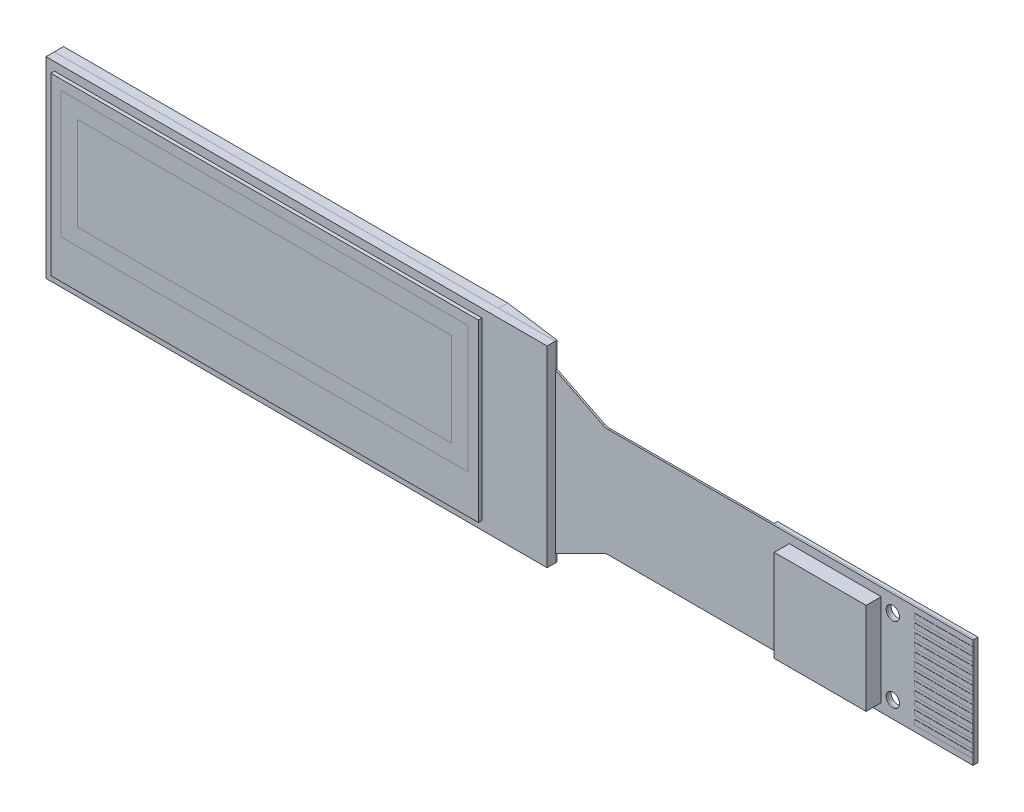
ISO-10303-21;
HEADER;
FILE_DESCRIPTION(('STEP AP214'),'2;1');
FILE_NAME('part.step','',(''),(''),'','','');
FILE_SCHEMA(('AUTOMOTIVE_DESIGN { 1 0 10303 214 1 1 1 1 }'));
ENDSEC;
DATA;
#1=APPLICATION_CONTEXT('core data for automotive mechanical design processes');
#2=APPLICATION_PROTOCOL_DEFINITION('international standard','automotive_design',2000,#1);
#3=PRODUCT_CONTEXT('',#1,'mechanical');
#4=PRODUCT('Part','Part','',(#3));
#5=PRODUCT_RELATED_PRODUCT_CATEGORY('part','',(#4));
#6=PRODUCT_DEFINITION_FORMATION('','',#4);
#7=PRODUCT_DEFINITION_CONTEXT('part definition',#1,'design');
#8=PRODUCT_DEFINITION('design','',#6,#7);
#9=PRODUCT_DEFINITION_SHAPE('','',#8);
#10=(LENGTH_UNIT() NAMED_UNIT(*) SI_UNIT(.MILLI.,.METRE.));
#11=(NAMED_UNIT(*) PLANE_ANGLE_UNIT() SI_UNIT($,.RADIAN.));
#12=(NAMED_UNIT(*) SI_UNIT($,.STERADIAN.) SOLID_ANGLE_UNIT());
#13=UNCERTAINTY_MEASURE_WITH_UNIT(LENGTH_MEASURE(1.E-05),#10,'distance_accuracy_value','');
#14=(GEOMETRIC_REPRESENTATION_CONTEXT(3) GLOBAL_UNCERTAINTY_ASSIGNED_CONTEXT((#13)) GLOBAL_UNIT_ASSIGNED_CONTEXT((#10,
#11,#12)) REPRESENTATION_CONTEXT('',''));
#15=CARTESIAN_POINT('',(0.,0.,0.));
#16=DIRECTION('',(0.,0.,1.));
#17=DIRECTION('',(1.,0.,0.));
#18=AXIS2_PLACEMENT_3D('',#15,#16,#17);
#19=CARTESIAN_POINT('',(11.6,9.1941980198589,0.));
#20=DIRECTION('',(1.,0.,0.));
#21=DIRECTION('',(0.,0.,-1.));
#22=AXIS2_PLACEMENT_3D('',#19,#20,#21);
#23=PLANE('',#22);
#24=DIRECTION('',(0.,0.,1.));
#25=VECTOR('',#24,1.);
#26=CARTESIAN_POINT('',(11.6,5.75,0.));
#27=LINE('',#26,#25);
#28=CARTESIAN_POINT('',(11.6,5.75,-0.55));
#29=VERTEX_POINT('',#28);
#30=CARTESIAN_POINT('',(11.6,5.75,0.));
#31=VERTEX_POINT('',#30);
#32=EDGE_CURVE('E289',#29,#31,#27,.T.);
#33=ORIENTED_EDGE('',*,*,#32,.F.);
#34=DIRECTION('',(0.,-1.,0.));
#35=VECTOR('',#34,1.);
#36=CARTESIAN_POINT('',(11.6,9.1941980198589,-0.55));
#37=LINE('',#36,#35);
#38=CARTESIAN_POINT('',(11.6,-5.75,-0.55));
#39=VERTEX_POINT('',#38);
#40=EDGE_CURVE('E227',#29,#39,#37,.T.);
#41=ORIENTED_EDGE('',*,*,#40,.T.);
#42=DIRECTION('',(0.,0.,-1.));
#43=VECTOR('',#42,1.);
#44=CARTESIAN_POINT('',(11.6,-5.75,0.));
#45=LINE('',#44,#43);
#46=CARTESIAN_POINT('',(11.6,-5.75,0.));
#47=VERTEX_POINT('',#46);
#48=EDGE_CURVE('E283',#47,#39,#45,.T.);
#49=ORIENTED_EDGE('',*,*,#48,.F.);
#50=DIRECTION('',(0.,-1.,0.));
#51=VECTOR('',#50,1.);
#52=CARTESIAN_POINT('',(11.6,9.1941980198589,0.));
#53=LINE('',#52,#51);
#54=EDGE_CURVE('E272',#31,#47,#53,.T.);
#55=ORIENTED_EDGE('',*,*,#54,.F.);
#56=EDGE_LOOP('',(#33,#41,#49,#55));
#57=FACE_BOUND('',#56,.T.);
#58=ADVANCED_FACE('F223',(#57),#23,.F.);
#59=CARTESIAN_POINT('',(15.,9.1941980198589,0.));
#60=DIRECTION('',(0.,0.,-1.));
#61=DIRECTION('',(-1.,0.,0.));
#62=AXIS2_PLACEMENT_3D('',#59,#60,#61);
#63=PLANE('',#62);
#64=DIRECTION('',(1.,0.,0.));
#65=VECTOR('',#64,1.);
#66=CARTESIAN_POINT('',(15.,5.75,0.));
#67=LINE('',#66,#65);
#68=CARTESIAN_POINT('',(15.,5.75,0.));
#69=VERTEX_POINT('',#68);
#70=EDGE_CURVE('E232',#31,#69,#67,.T.);
#71=ORIENTED_EDGE('',*,*,#70,.F.);
#72=ORIENTED_EDGE('',*,*,#54,.T.);
#73=DIRECTION('',(-1.,0.,0.));
#74=VECTOR('',#73,1.);
#75=CARTESIAN_POINT('',(15.,-5.75,0.));
#76=LINE('',#75,#74);
#77=CARTESIAN_POINT('',(15.,-5.75,0.));
#78=VERTEX_POINT('',#77);
#79=EDGE_CURVE('E278',#78,#47,#76,.T.);
#80=ORIENTED_EDGE('',*,*,#79,.F.);
#81=DIRECTION('',(0.,-1.,0.));
#82=VECTOR('',#81,1.);
#83=CARTESIAN_POINT('',(15.,9.1941980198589,0.));
#84=LINE('',#83,#82);
#85=EDGE_CURVE('E267',#69,#78,#84,.T.);
#86=ORIENTED_EDGE('',*,*,#85,.F.);
#87=EDGE_LOOP('',(#71,#72,#80,#86));
#88=FACE_BOUND('',#87,.T.);
#89=ADVANCED_FACE('F282',(#88),#63,.F.);
#90=CARTESIAN_POINT('',(15.,9.1941980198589,-0.1));
#91=DIRECTION('',(-1.,0.,0.));
#92=DIRECTION('',(0.,0.,1.));
#93=AXIS2_PLACEMENT_3D('',#90,#91,#92);
#94=PLANE('',#93);
#95=DIRECTION('',(0.,0.,-1.));
#96=VECTOR('',#95,1.);
#97=CARTESIAN_POINT('',(15.,5.75,-0.1));
#98=LINE('',#97,#96);
#99=CARTESIAN_POINT('',(15.,5.75,-0.1));
#100=VERTEX_POINT('',#99);
#101=EDGE_CURVE('E13',#69,#100,#98,.T.);
#102=ORIENTED_EDGE('',*,*,#101,.F.);
#103=ORIENTED_EDGE('',*,*,#85,.T.);
#104=DIRECTION('',(0.,0.,1.));
#105=VECTOR('',#104,1.);
#106=CARTESIAN_POINT('',(15.,-5.75,-0.1));
#107=LINE('',#106,#105);
#108=CARTESIAN_POINT('',(15.,-5.75,-0.1));
#109=VERTEX_POINT('',#108);
#110=EDGE_CURVE('E270',#109,#78,#107,.T.);
#111=ORIENTED_EDGE('',*,*,#110,.F.);
#112=DIRECTION('',(0.,-1.,0.));
#113=VECTOR('',#112,1.);
#114=CARTESIAN_POINT('',(15.,9.1941980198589,-0.1));
#115=LINE('',#114,#113);
#116=EDGE_CURVE('E248',#100,#109,#115,.T.);
#117=ORIENTED_EDGE('',*,*,#116,.F.);
#118=EDGE_LOOP('',(#102,#103,#111,#117));
#119=FACE_BOUND('',#118,.T.);
#120=ADVANCED_FACE('F269',(#119),#94,.F.);
#121=CARTESIAN_POINT('',(11.6,9.1941980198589,-0.55));
#122=DIRECTION('',(-0.131208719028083,0.,0.991354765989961));
#123=DIRECTION('',(0.991354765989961,0.,0.131208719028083));
#124=AXIS2_PLACEMENT_3D('',#121,#122,#123);
#125=PLANE('',#124);
#126=DIRECTION('',(-0.991354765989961,0.,-0.131208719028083));
#127=VECTOR('',#126,1.);
#128=CARTESIAN_POINT('',(11.6,5.75,-0.55));
#129=LINE('',#128,#127);
#130=EDGE_CURVE('E292',#100,#29,#129,.T.);
#131=ORIENTED_EDGE('',*,*,#130,.F.);
#132=ORIENTED_EDGE('',*,*,#116,.T.);
#133=DIRECTION('',(0.991354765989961,0.,0.131208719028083));
#134=VECTOR('',#133,1.);
#135=CARTESIAN_POINT('',(11.6,-5.75,-0.55));
#136=LINE('',#135,#134);
#137=EDGE_CURVE('E280',#39,#109,#136,.T.);
#138=ORIENTED_EDGE('',*,*,#137,.F.);
#139=ORIENTED_EDGE('',*,*,#40,.F.);
#140=EDGE_LOOP('',(#131,#132,#138,#139));
#141=FACE_BOUND('',#140,.T.);
#142=ADVANCED_FACE('F296',(#141),#125,.F.);
#143=CARTESIAN_POINT('',(0.,5.75,0.5));
#144=DIRECTION('',(0.,1.,0.));
#145=DIRECTION('',(0.,0.,1.));
#146=AXIS2_PLACEMENT_3D('',#143,#144,#145);
#147=PLANE('',#146);
#148=ORIENTED_EDGE('',*,*,#130,.T.);
#149=ORIENTED_EDGE('',*,*,#32,.T.);
#150=ORIENTED_EDGE('',*,*,#70,.T.);
#151=ORIENTED_EDGE('',*,*,#101,.T.);
#152=EDGE_LOOP('',(#148,#149,#150,#151));
#153=FACE_BOUND('',#152,.T.);
#154=ADVANCED_FACE('F225',(#153),#147,.T.);
#155=CARTESIAN_POINT('',(0.,-5.75,0.5));
#156=DIRECTION('',(0.,1.,0.));
#157=DIRECTION('',(-1.,0.,0.));
#158=AXIS2_PLACEMENT_3D('',#155,#156,#157);
#159=PLANE('',#158);
#160=ORIENTED_EDGE('',*,*,#48,.T.);
#161=ORIENTED_EDGE('',*,*,#137,.T.);
#162=ORIENTED_EDGE('',*,*,#110,.T.);
#163=ORIENTED_EDGE('',*,*,#79,.T.);
#164=EDGE_LOOP('',(#160,#161,#162,#163));
#165=FACE_BOUND('',#164,.T.);
#166=ADVANCED_FACE('F277',(#165),#159,.F.);
#167=CLOSED_SHELL('',(#58,#89,#120,#142,#154,#166));
#168=MANIFOLD_SOLID_BREP('B2',#167);
#169=CARTESIAN_POINT('',(0.,-3.75,-0.3));
#170=DIRECTION('',(0.,-1.,0.));
#171=DIRECTION('',(1.,0.,0.));
#172=AXIS2_PLACEMENT_3D('',#169,#170,#171);
#173=PLANE('',#172);
#174=DIRECTION('',(1.,0.,0.));
#175=VECTOR('',#174,1.);
#176=CARTESIAN_POINT('',(0.,-3.75,-0.1));
#177=LINE('',#176,#175);
#178=CARTESIAN_POINT('',(28.,-3.75,-0.1));
#179=VERTEX_POINT('',#178);
#180=CARTESIAN_POINT('',(40.,-3.75,-0.1));
#181=VERTEX_POINT('',#180);
#182=EDGE_CURVE('E403',#179,#181,#177,.T.);
#183=ORIENTED_EDGE('',*,*,#182,.F.);
#184=DIRECTION('',(0.,0.,1.));
#185=VECTOR('',#184,1.);
#186=CARTESIAN_POINT('',(28.,-3.75,-0.3));
#187=LINE('',#186,#185);
#188=CARTESIAN_POINT('',(28.,-3.75,-0.3));
#189=VERTEX_POINT('',#188);
#190=EDGE_CURVE('E364',#189,#179,#187,.T.);
#191=ORIENTED_EDGE('',*,*,#190,.F.);
#192=DIRECTION('',(1.,0.,0.));
#193=VECTOR('',#192,1.);
#194=CARTESIAN_POINT('',(0.,-3.75,-0.3));
#195=LINE('',#194,#193);
#196=CARTESIAN_POINT('',(40.,-3.75,-0.3));
#197=VERTEX_POINT('',#196);
#198=EDGE_CURVE('E401',#189,#197,#195,.T.);
#199=ORIENTED_EDGE('',*,*,#198,.T.);
#200=DIRECTION('',(0.,0.,1.));
#201=VECTOR('',#200,1.);
#202=CARTESIAN_POINT('',(40.,-3.75,-0.3));
#203=LINE('',#202,#201);
#204=EDGE_CURVE('E221',#197,#181,#203,.T.);
#205=ORIENTED_EDGE('',*,*,#204,.T.);
#206=EDGE_LOOP('',(#183,#191,#199,#205));
#207=FACE_BOUND('',#206,.T.);
#208=ADVANCED_FACE('F356',(#207),#173,.T.);
#209=CARTESIAN_POINT('',(28.,0.,-0.3));
#210=DIRECTION('',(-1.,0.,0.));
#211=DIRECTION('',(0.,0.,1.));
#212=AXIS2_PLACEMENT_3D('',#209,#210,#211);
#213=PLANE('',#212);
#214=DIRECTION('',(0.,-1.,0.));
#215=VECTOR('',#214,1.);
#216=CARTESIAN_POINT('',(28.,0.,-0.1));
#217=LINE('',#216,#215);
#218=CARTESIAN_POINT('',(28.,2.75,-0.1));
#219=VERTEX_POINT('',#218);
#220=EDGE_CURVE('E421',#219,#179,#217,.T.);
#221=ORIENTED_EDGE('',*,*,#220,.F.);
#222=DIRECTION('',(0.,0.,1.));
#223=VECTOR('',#222,1.);
#224=CARTESIAN_POINT('',(28.,2.75,-0.3));
#225=LINE('',#224,#223);
#226=CARTESIAN_POINT('',(28.,2.75,-0.3));
#227=VERTEX_POINT('',#226);
#228=EDGE_CURVE('E389',#227,#219,#225,.T.);
#229=ORIENTED_EDGE('',*,*,#228,.F.);
#230=DIRECTION('',(0.,-1.,0.));
#231=VECTOR('',#230,1.);
#232=CARTESIAN_POINT('',(28.,0.,-0.3));
#233=LINE('',#232,#231);
#234=EDGE_CURVE('E411',#227,#189,#233,.T.);
#235=ORIENTED_EDGE('',*,*,#234,.T.);
#236=ORIENTED_EDGE('',*,*,#190,.T.);
#237=EDGE_LOOP('',(#221,#229,#235,#236));
#238=FACE_BOUND('',#237,.T.);
#239=ADVANCED_FACE('F413',(#238),#213,.T.);
#240=CARTESIAN_POINT('',(0.,2.75,-0.3));
#241=DIRECTION('',(0.,-1.,0.));
#242=DIRECTION('',(0.,0.,-1.));
#243=AXIS2_PLACEMENT_3D('',#240,#241,#242);
#244=PLANE('',#243);
#245=DIRECTION('',(1.,0.,0.));
#246=VECTOR('',#245,1.);
#247=CARTESIAN_POINT('',(0.,2.75,-0.1));
#248=LINE('',#247,#246);
#249=CARTESIAN_POINT('',(40.,2.75,-0.1));
#250=VERTEX_POINT('',#249);
#251=EDGE_CURVE('E393',#219,#250,#248,.T.);
#252=ORIENTED_EDGE('',*,*,#251,.T.);
#253=DIRECTION('',(0.,0.,1.));
#254=VECTOR('',#253,1.);
#255=CARTESIAN_POINT('',(40.,2.75,-0.3));
#256=LINE('',#255,#254);
#257=CARTESIAN_POINT('',(40.,2.75,-0.3));
#258=VERTEX_POINT('',#257);
#259=EDGE_CURVE('E416',#258,#250,#256,.T.);
#260=ORIENTED_EDGE('',*,*,#259,.F.);
#261=DIRECTION('',(1.,0.,0.));
#262=VECTOR('',#261,1.);
#263=CARTESIAN_POINT('',(0.,2.75,-0.3));
#264=LINE('',#263,#262);
#265=EDGE_CURVE('E414',#227,#258,#264,.T.);
#266=ORIENTED_EDGE('',*,*,#265,.F.);
#267=ORIENTED_EDGE('',*,*,#228,.T.);
#268=EDGE_LOOP('',(#252,#260,#266,#267));
#269=FACE_BOUND('',#268,.T.);
#270=ADVANCED_FACE('F466',(#269),#244,.F.);
#271=CARTESIAN_POINT('',(40.,0.,-0.3));
#272=DIRECTION('',(-1.,0.,0.));
#273=DIRECTION('',(0.,0.,1.));
#274=AXIS2_PLACEMENT_3D('',#271,#272,#273);
#275=PLANE('',#274);
#276=DIRECTION('',(0.,-1.,0.));
#277=VECTOR('',#276,1.);
#278=CARTESIAN_POINT('',(40.,0.,-0.1));
#279=LINE('',#278,#277);
#280=EDGE_CURVE('E425',#250,#181,#279,.T.);
#281=ORIENTED_EDGE('',*,*,#280,.T.);
#282=ORIENTED_EDGE('',*,*,#204,.F.);
#283=DIRECTION('',(0.,-1.,0.));
#284=VECTOR('',#283,1.);
#285=CARTESIAN_POINT('',(40.,0.,-0.3));
#286=LINE('',#285,#284);
#287=EDGE_CURVE('E372',#258,#197,#286,.T.);
#288=ORIENTED_EDGE('',*,*,#287,.F.);
#289=ORIENTED_EDGE('',*,*,#259,.T.);
#290=EDGE_LOOP('',(#281,#282,#288,#289));
#291=FACE_BOUND('',#290,.T.);
#292=ADVANCED_FACE('F429',(#291),#275,.F.);
#293=CARTESIAN_POINT('',(35.2,1.75,-0.3));
#294=DIRECTION('',(0.,0.,1.));
#295=DIRECTION('',(1.,0.,0.));
#296=AXIS2_PLACEMENT_3D('',#293,#294,#295);
#297=CYLINDRICAL_SURFACE('',#296,0.399999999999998);
#298=CARTESIAN_POINT('',(35.2,1.75,-0.3));
#299=DIRECTION('',(0.,0.,1.));
#300=DIRECTION('',(1.,0.,0.));
#301=AXIS2_PLACEMENT_3D('',#298,#299,#300);
#302=CIRCLE('',#301,0.399999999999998);
#303=CARTESIAN_POINT('',(35.6,1.75,-0.3));
#304=VERTEX_POINT('',#303);
#305=EDGE_CURVE('E422',#304,#304,#302,.T.);
#306=ORIENTED_EDGE('',*,*,#305,.F.);
#307=EDGE_LOOP('',(#306));
#308=FACE_BOUND('',#307,.T.);
#309=CARTESIAN_POINT('',(35.2,1.75,-0.1));
#310=DIRECTION('',(0.,0.,1.));
#311=DIRECTION('',(1.,0.,0.));
#312=AXIS2_PLACEMENT_3D('',#309,#310,#311);
#313=CIRCLE('',#312,0.399999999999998);
#314=CARTESIAN_POINT('',(35.6,1.75,-0.1));
#315=VERTEX_POINT('',#314);
#316=EDGE_CURVE('E442',#315,#315,#313,.T.);
#317=ORIENTED_EDGE('',*,*,#316,.T.);
#318=EDGE_LOOP('',(#317));
#319=FACE_BOUND('',#318,.T.);
#320=ADVANCED_FACE('F453',(#308,#319),#297,.F.);
#321=CARTESIAN_POINT('',(35.2,-2.75,-0.3));
#322=DIRECTION('',(0.,0.,1.));
#323=DIRECTION('',(1.,0.,0.));
#324=AXIS2_PLACEMENT_3D('',#321,#322,#323);
#325=CYLINDRICAL_SURFACE('',#324,0.399999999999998);
#326=CARTESIAN_POINT('',(35.2,-2.75,-0.3));
#327=DIRECTION('',(0.,0.,1.));
#328=DIRECTION('',(1.,0.,0.));
#329=AXIS2_PLACEMENT_3D('',#326,#327,#328);
#330=CIRCLE('',#329,0.399999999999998);
#331=CARTESIAN_POINT('',(35.6,-2.75,-0.3));
#332=VERTEX_POINT('',#331);
#333=EDGE_CURVE('E444',#332,#332,#330,.T.);
#334=ORIENTED_EDGE('',*,*,#333,.F.);
#335=EDGE_LOOP('',(#334));
#336=FACE_BOUND('',#335,.T.);
#337=CARTESIAN_POINT('',(35.2,-2.75,-0.1));
#338=DIRECTION('',(0.,0.,1.));
#339=DIRECTION('',(1.,0.,0.));
#340=AXIS2_PLACEMENT_3D('',#337,#338,#339);
#341=CIRCLE('',#340,0.399999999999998);
#342=CARTESIAN_POINT('',(35.6,-2.75,-0.1));
#343=VERTEX_POINT('',#342);
#344=EDGE_CURVE('E439',#343,#343,#341,.T.);
#345=ORIENTED_EDGE('',*,*,#344,.T.);
#346=EDGE_LOOP('',(#345));
#347=FACE_BOUND('',#346,.T.);
#348=ADVANCED_FACE('F434',(#336,#347),#325,.F.);
#349=CARTESIAN_POINT('',(0.,0.,-0.1));
#350=DIRECTION('',(0.,0.,1.));
#351=DIRECTION('',(1.,0.,0.));
#352=AXIS2_PLACEMENT_3D('',#349,#350,#351);
#353=PLANE('',#352);
#354=ORIENTED_EDGE('',*,*,#182,.T.);
#355=ORIENTED_EDGE('',*,*,#280,.F.);
#356=ORIENTED_EDGE('',*,*,#251,.F.);
#357=ORIENTED_EDGE('',*,*,#220,.T.);
#358=EDGE_LOOP('',(#354,#355,#356,#357));
#359=FACE_BOUND('',#358,.T.);
#360=ORIENTED_EDGE('',*,*,#344,.F.);
#361=EDGE_LOOP('',(#360));
#362=FACE_BOUND('',#361,.T.);
#363=ORIENTED_EDGE('',*,*,#316,.F.);
#364=EDGE_LOOP('',(#363));
#365=FACE_BOUND('',#364,.T.);
#366=ADVANCED_FACE('F431',(#359,#362,#365),#353,.T.);
#367=CARTESIAN_POINT('',(0.,0.,-0.3));
#368=DIRECTION('',(0.,0.,1.));
#369=DIRECTION('',(1.,0.,0.));
#370=AXIS2_PLACEMENT_3D('',#367,#368,#369);
#371=PLANE('',#370);
#372=ORIENTED_EDGE('',*,*,#265,.T.);
#373=ORIENTED_EDGE('',*,*,#287,.T.);
#374=ORIENTED_EDGE('',*,*,#198,.F.);
#375=ORIENTED_EDGE('',*,*,#234,.F.);
#376=EDGE_LOOP('',(#372,#373,#374,#375));
#377=FACE_BOUND('',#376,.T.);
#378=ORIENTED_EDGE('',*,*,#333,.T.);
#379=EDGE_LOOP('',(#378));
#380=FACE_BOUND('',#379,.T.);
#381=ORIENTED_EDGE('',*,*,#305,.T.);
#382=EDGE_LOOP('',(#381));
#383=FACE_BOUND('',#382,.T.);
#384=ADVANCED_FACE('F409',(#377,#380,#383),#371,.F.);
#385=CLOSED_SHELL('',(#208,#239,#270,#292,#320,#348,#366,#384));
#386=MANIFOLD_SOLID_BREP('B7',#385);
#387=CARTESIAN_POINT('',(0.,0.,0.));
#388=DIRECTION('',(0.,0.,1.));
#389=DIRECTION('',(1.,0.,0.));
#390=AXIS2_PLACEMENT_3D('',#387,#388,#389);
#391=PLANE('',#390);
#392=DIRECTION('',(-1.,0.,0.));
#393=VECTOR('',#392,1.);
#394=CARTESIAN_POINT('',(0.,-3.25,0.));
#395=LINE('',#394,#393);
#396=CARTESIAN_POINT('',(34.5,-3.25,0.));
#397=VERTEX_POINT('',#396);
#398=CARTESIAN_POINT('',(29.,-3.25,0.));
#399=VERTEX_POINT('',#398);
#400=EDGE_CURVE('E1099',#397,#399,#395,.T.);
#401=ORIENTED_EDGE('',*,*,#400,.T.);
#402=DIRECTION('',(0.,1.,0.));
#403=VECTOR('',#402,1.);
#404=CARTESIAN_POINT('',(29.,0.,0.));
#405=LINE('',#404,#403);
#406=CARTESIAN_POINT('',(29.,2.25,0.));
#407=VERTEX_POINT('',#406);
#408=EDGE_CURVE('E1076',#399,#407,#405,.T.);
#409=ORIENTED_EDGE('',*,*,#408,.T.);
#410=DIRECTION('',(-1.,0.,0.));
#411=VECTOR('',#410,1.);
#412=CARTESIAN_POINT('',(0.,2.25,0.));
#413=LINE('',#412,#411);
#414=CARTESIAN_POINT('',(34.5,2.25,0.));
#415=VERTEX_POINT('',#414);
#416=EDGE_CURVE('E716',#415,#407,#413,.T.);
#417=ORIENTED_EDGE('',*,*,#416,.F.);
#418=DIRECTION('',(0.,1.,0.));
#419=VECTOR('',#418,1.);
#420=CARTESIAN_POINT('',(34.5,0.,0.));
#421=LINE('',#420,#419);
#422=EDGE_CURVE('E711',#397,#415,#421,.T.);
#423=ORIENTED_EDGE('',*,*,#422,.F.);
#424=EDGE_LOOP('',(#401,#409,#417,#423));
#425=FACE_BOUND('',#424,.T.);
#426=CARTESIAN_POINT('',(35.2,1.75,0.));
#427=DIRECTION('',(0.,0.,1.));
#428=DIRECTION('',(1.,0.,0.));
#429=AXIS2_PLACEMENT_3D('',#426,#427,#428);
#430=CIRCLE('',#429,0.399999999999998);
#431=CARTESIAN_POINT('',(35.6,1.75,0.));
#432=VERTEX_POINT('',#431);
#433=EDGE_CURVE('E1556',#432,#432,#430,.T.);
#434=ORIENTED_EDGE('',*,*,#433,.F.);
#435=EDGE_LOOP('',(#434));
#436=FACE_BOUND('',#435,.T.);
#437=CARTESIAN_POINT('',(35.2,-2.75,0.));
#438=DIRECTION('',(0.,0.,1.));
#439=DIRECTION('',(1.,0.,0.));
#440=AXIS2_PLACEMENT_3D('',#437,#438,#439);
#441=CIRCLE('',#440,0.399999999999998);
#442=CARTESIAN_POINT('',(35.6,-2.75,0.));
#443=VERTEX_POINT('',#442);
#444=EDGE_CURVE('E1559',#443,#443,#441,.F.);
#445=ORIENTED_EDGE('',*,*,#444,.T.);
#446=EDGE_LOOP('',(#445));
#447=FACE_BOUND('',#446,.T.);
#448=DIRECTION('',(0.,1.,0.));
#449=VECTOR('',#448,1.);
#450=CARTESIAN_POINT('',(36.5,0.,0.));
#451=LINE('',#450,#449);
#452=CARTESIAN_POINT('',(36.5,-2.4,0.));
#453=VERTEX_POINT('',#452);
#454=CARTESIAN_POINT('',(36.5,-2.1,0.));
#455=VERTEX_POINT('',#454);
#456=EDGE_CURVE('E1121',#453,#455,#451,.T.);
#457=ORIENTED_EDGE('',*,*,#456,.T.);
#458=DIRECTION('',(-1.,0.,0.));
#459=VECTOR('',#458,1.);
#460=CARTESIAN_POINT('',(0.,-2.1,0.));
#461=LINE('',#460,#459);
#462=CARTESIAN_POINT('',(40.,-2.1,0.));
#463=VERTEX_POINT('',#462);
#464=EDGE_CURVE('E1125',#463,#455,#461,.T.);
#465=ORIENTED_EDGE('',*,*,#464,.F.);
#466=DIRECTION('',(0.,-1.,0.));
#467=VECTOR('',#466,1.);
#468=CARTESIAN_POINT('',(40.,0.,0.));
#469=LINE('',#468,#467);
#470=CARTESIAN_POINT('',(40.,-1.9,0.));
#471=VERTEX_POINT('',#470);
#472=EDGE_CURVE('E1493',#471,#463,#469,.T.);
#473=ORIENTED_EDGE('',*,*,#472,.F.);
#474=DIRECTION('',(-1.,0.,0.));
#475=VECTOR('',#474,1.);
#476=CARTESIAN_POINT('',(0.,-1.9,0.));
#477=LINE('',#476,#475);
#478=CARTESIAN_POINT('',(36.5,-1.9,0.));
#479=VERTEX_POINT('',#478);
#480=EDGE_CURVE('E1206',#471,#479,#477,.T.);
#481=ORIENTED_EDGE('',*,*,#480,.T.);
#482=DIRECTION('',(0.,1.,0.));
#483=VECTOR('',#482,1.);
#484=CARTESIAN_POINT('',(36.5,0.,0.));
#485=LINE('',#484,#483);
#486=CARTESIAN_POINT('',(36.5,-1.6,0.));
#487=VERTEX_POINT('',#486);
#488=EDGE_CURVE('E1209',#479,#487,#485,.T.);
#489=ORIENTED_EDGE('',*,*,#488,.T.);
#490=DIRECTION('',(-1.,0.,0.));
#491=VECTOR('',#490,1.);
#492=CARTESIAN_POINT('',(0.,-1.6,0.));
#493=LINE('',#492,#491);
#494=CARTESIAN_POINT('',(40.,-1.6,0.));
#495=VERTEX_POINT('',#494);
#496=EDGE_CURVE('E1213',#495,#487,#493,.T.);
#497=ORIENTED_EDGE('',*,*,#496,.F.);
#498=CARTESIAN_POINT('',(40.,-1.4,0.));
#499=VERTEX_POINT('',#498);
#500=EDGE_CURVE('E1490',#499,#495,#469,.T.);
#501=ORIENTED_EDGE('',*,*,#500,.F.);
#502=DIRECTION('',(-1.,0.,0.));
#503=VECTOR('',#502,1.);
#504=CARTESIAN_POINT('',(0.,-1.4,0.));
#505=LINE('',#504,#503);
#506=CARTESIAN_POINT('',(36.5,-1.4,0.));
#507=VERTEX_POINT('',#506);
#508=EDGE_CURVE('E1235',#499,#507,#505,.T.);
#509=ORIENTED_EDGE('',*,*,#508,.T.);
#510=DIRECTION('',(0.,1.,0.));
#511=VECTOR('',#510,1.);
#512=CARTESIAN_POINT('',(36.5,0.,0.));
#513=LINE('',#512,#511);
#514=CARTESIAN_POINT('',(36.5,-1.1,0.));
#515=VERTEX_POINT('',#514);
#516=EDGE_CURVE('E1238',#507,#515,#513,.T.);
#517=ORIENTED_EDGE('',*,*,#516,.T.);
#518=DIRECTION('',(-1.,0.,0.));
#519=VECTOR('',#518,1.);
#520=CARTESIAN_POINT('',(0.,-1.1,0.));
#521=LINE('',#520,#519);
#522=CARTESIAN_POINT('',(40.,-1.1,0.));
#523=VERTEX_POINT('',#522);
#524=EDGE_CURVE('E1242',#523,#515,#521,.T.);
#525=ORIENTED_EDGE('',*,*,#524,.F.);
#526=CARTESIAN_POINT('',(40.,-0.900000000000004,0.));
#527=VERTEX_POINT('',#526);
#528=EDGE_CURVE('E1487',#527,#523,#469,.T.);
#529=ORIENTED_EDGE('',*,*,#528,.F.);
#530=DIRECTION('',(-1.,0.,0.));
#531=VECTOR('',#530,1.);
#532=CARTESIAN_POINT('',(0.,-0.900000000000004,0.));
#533=LINE('',#532,#531);
#534=CARTESIAN_POINT('',(36.5,-0.900000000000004,0.));
#535=VERTEX_POINT('',#534);
#536=EDGE_CURVE('E1264',#527,#535,#533,.T.);
#537=ORIENTED_EDGE('',*,*,#536,.T.);
#538=DIRECTION('',(0.,1.,0.));
#539=VECTOR('',#538,1.);
#540=CARTESIAN_POINT('',(36.5,0.,0.));
#541=LINE('',#540,#539);
#542=CARTESIAN_POINT('',(36.5,-0.600000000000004,0.));
#543=VERTEX_POINT('',#542);
#544=EDGE_CURVE('E1267',#535,#543,#541,.T.);
#545=ORIENTED_EDGE('',*,*,#544,.T.);
#546=DIRECTION('',(-1.,0.,0.));
#547=VECTOR('',#546,1.);
#548=CARTESIAN_POINT('',(0.,-0.600000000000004,0.));
#549=LINE('',#548,#547);
#550=CARTESIAN_POINT('',(40.,-0.600000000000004,0.));
#551=VERTEX_POINT('',#550);
#552=EDGE_CURVE('E1271',#551,#543,#549,.T.);
#553=ORIENTED_EDGE('',*,*,#552,.F.);
#554=CARTESIAN_POINT('',(40.,-0.400000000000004,0.));
#555=VERTEX_POINT('',#554);
#556=EDGE_CURVE('E1484',#555,#551,#469,.T.);
#557=ORIENTED_EDGE('',*,*,#556,.F.);
#558=DIRECTION('',(-1.,0.,0.));
#559=VECTOR('',#558,1.);
#560=CARTESIAN_POINT('',(0.,-0.400000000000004,0.));
#561=LINE('',#560,#559);
#562=CARTESIAN_POINT('',(36.5,-0.400000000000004,0.));
#563=VERTEX_POINT('',#562);
#564=EDGE_CURVE('E1293',#555,#563,#561,.T.);
#565=ORIENTED_EDGE('',*,*,#564,.T.);
#566=DIRECTION('',(0.,1.,0.));
#567=VECTOR('',#566,1.);
#568=CARTESIAN_POINT('',(36.5,0.,0.));
#569=LINE('',#568,#567);
#570=CARTESIAN_POINT('',(36.5,-0.100000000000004,0.));
#571=VERTEX_POINT('',#570);
#572=EDGE_CURVE('E1296',#563,#571,#569,.T.);
#573=ORIENTED_EDGE('',*,*,#572,.T.);
#574=DIRECTION('',(-1.,0.,0.));
#575=VECTOR('',#574,1.);
#576=CARTESIAN_POINT('',(0.,-0.100000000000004,0.));
#577=LINE('',#576,#575);
#578=CARTESIAN_POINT('',(40.,-0.100000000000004,0.));
#579=VERTEX_POINT('',#578);
#580=EDGE_CURVE('E1300',#579,#571,#577,.T.);
#581=ORIENTED_EDGE('',*,*,#580,.F.);
#582=CARTESIAN_POINT('',(40.,0.0999999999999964,0.));
#583=VERTEX_POINT('',#582);
#584=EDGE_CURVE('E1481',#583,#579,#469,.T.);
#585=ORIENTED_EDGE('',*,*,#584,.F.);
#586=DIRECTION('',(-1.,0.,0.));
#587=VECTOR('',#586,1.);
#588=CARTESIAN_POINT('',(0.,0.0999999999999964,0.));
#589=LINE('',#588,#587);
#590=CARTESIAN_POINT('',(36.5,0.0999999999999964,0.));
#591=VERTEX_POINT('',#590);
#592=EDGE_CURVE('E1322',#583,#591,#589,.T.);
#593=ORIENTED_EDGE('',*,*,#592,.T.);
#594=DIRECTION('',(0.,1.,0.));
#595=VECTOR('',#594,1.);
#596=CARTESIAN_POINT('',(36.5,0.,0.));
#597=LINE('',#596,#595);
#598=CARTESIAN_POINT('',(36.5,0.399999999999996,0.));
#599=VERTEX_POINT('',#598);
#600=EDGE_CURVE('E1325',#591,#599,#597,.T.);
#601=ORIENTED_EDGE('',*,*,#600,.T.);
#602=DIRECTION('',(-1.,0.,0.));
#603=VECTOR('',#602,1.);
#604=CARTESIAN_POINT('',(0.,0.399999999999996,0.));
#605=LINE('',#604,#603);
#606=CARTESIAN_POINT('',(40.,0.399999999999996,0.));
#607=VERTEX_POINT('',#606);
#608=EDGE_CURVE('E1329',#607,#599,#605,.T.);
#609=ORIENTED_EDGE('',*,*,#608,.F.);
#610=CARTESIAN_POINT('',(40.,0.599999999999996,0.));
#611=VERTEX_POINT('',#610);
#612=EDGE_CURVE('E1478',#611,#607,#469,.T.);
#613=ORIENTED_EDGE('',*,*,#612,.F.);
#614=DIRECTION('',(-1.,0.,0.));
#615=VECTOR('',#614,1.);
#616=CARTESIAN_POINT('',(0.,0.599999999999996,0.));
#617=LINE('',#616,#615);
#618=CARTESIAN_POINT('',(36.5,0.599999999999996,0.));
#619=VERTEX_POINT('',#618);
#620=EDGE_CURVE('E1351',#611,#619,#617,.T.);
#621=ORIENTED_EDGE('',*,*,#620,.T.);
#622=DIRECTION('',(0.,1.,0.));
#623=VECTOR('',#622,1.);
#624=CARTESIAN_POINT('',(36.5,0.,0.));
#625=LINE('',#624,#623);
#626=CARTESIAN_POINT('',(36.5,0.899999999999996,0.));
#627=VERTEX_POINT('',#626);
#628=EDGE_CURVE('E1354',#619,#627,#625,.T.);
#629=ORIENTED_EDGE('',*,*,#628,.T.);
#630=DIRECTION('',(-1.,0.,0.));
#631=VECTOR('',#630,1.);
#632=CARTESIAN_POINT('',(0.,0.899999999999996,0.));
#633=LINE('',#632,#631);
#634=CARTESIAN_POINT('',(40.,0.899999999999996,0.));
#635=VERTEX_POINT('',#634);
#636=EDGE_CURVE('E1358',#635,#627,#633,.T.);
#637=ORIENTED_EDGE('',*,*,#636,.F.);
#638=CARTESIAN_POINT('',(40.,1.1,0.));
#639=VERTEX_POINT('',#638);
#640=EDGE_CURVE('E1457',#639,#635,#469,.T.);
#641=ORIENTED_EDGE('',*,*,#640,.F.);
#642=DIRECTION('',(-1.,0.,0.));
#643=VECTOR('',#642,1.);
#644=CARTESIAN_POINT('',(0.,1.1,0.));
#645=LINE('',#644,#643);
#646=CARTESIAN_POINT('',(36.5,1.1,0.));
#647=VERTEX_POINT('',#646);
#648=EDGE_CURVE('E1380',#639,#647,#645,.T.);
#649=ORIENTED_EDGE('',*,*,#648,.T.);
#650=DIRECTION('',(0.,1.,0.));
#651=VECTOR('',#650,1.);
#652=CARTESIAN_POINT('',(36.5,0.,0.));
#653=LINE('',#652,#651);
#654=CARTESIAN_POINT('',(36.5,1.4,0.));
#655=VERTEX_POINT('',#654);
#656=EDGE_CURVE('E1383',#647,#655,#653,.T.);
#657=ORIENTED_EDGE('',*,*,#656,.T.);
#658=DIRECTION('',(-1.,0.,0.));
#659=VECTOR('',#658,1.);
#660=CARTESIAN_POINT('',(0.,1.4,0.));
#661=LINE('',#660,#659);
#662=CARTESIAN_POINT('',(40.,1.4,0.));
#663=VERTEX_POINT('',#662);
#664=EDGE_CURVE('E1387',#663,#655,#661,.T.);
#665=ORIENTED_EDGE('',*,*,#664,.F.);
#666=CARTESIAN_POINT('',(40.,1.6,0.));
#667=VERTEX_POINT('',#666);
#668=EDGE_CURVE('E1453',#667,#663,#469,.T.);
#669=ORIENTED_EDGE('',*,*,#668,.F.);
#670=DIRECTION('',(-1.,0.,0.));
#671=VECTOR('',#670,1.);
#672=CARTESIAN_POINT('',(0.,1.6,0.));
#673=LINE('',#672,#671);
#674=CARTESIAN_POINT('',(36.5,1.6,0.));
#675=VERTEX_POINT('',#674);
#676=EDGE_CURVE('E1409',#667,#675,#673,.T.);
#677=ORIENTED_EDGE('',*,*,#676,.T.);
#678=DIRECTION('',(0.,1.,0.));
#679=VECTOR('',#678,1.);
#680=CARTESIAN_POINT('',(36.5,0.,0.));
#681=LINE('',#680,#679);
#682=CARTESIAN_POINT('',(36.5,1.9,0.));
#683=VERTEX_POINT('',#682);
#684=EDGE_CURVE('E1412',#675,#683,#681,.T.);
#685=ORIENTED_EDGE('',*,*,#684,.T.);
#686=DIRECTION('',(-1.,0.,0.));
#687=VECTOR('',#686,1.);
#688=CARTESIAN_POINT('',(0.,1.9,0.));
#689=LINE('',#688,#687);
#690=CARTESIAN_POINT('',(40.,1.9,0.));
#691=VERTEX_POINT('',#690);
#692=EDGE_CURVE('E1416',#691,#683,#689,.T.);
#693=ORIENTED_EDGE('',*,*,#692,.F.);
#694=CARTESIAN_POINT('',(40.,2.1,0.));
#695=VERTEX_POINT('',#694);
#696=EDGE_CURVE('E1456',#695,#691,#469,.T.);
#697=ORIENTED_EDGE('',*,*,#696,.F.);
#698=DIRECTION('',(-1.,0.,0.));
#699=VECTOR('',#698,1.);
#700=CARTESIAN_POINT('',(0.,2.1,0.));
#701=LINE('',#700,#699);
#702=CARTESIAN_POINT('',(36.5,2.1,0.));
#703=VERTEX_POINT('',#702);
#704=EDGE_CURVE('E1433',#695,#703,#701,.T.);
#705=ORIENTED_EDGE('',*,*,#704,.T.);
#706=DIRECTION('',(0.,1.,0.));
#707=VECTOR('',#706,1.);
#708=CARTESIAN_POINT('',(36.5,0.,0.));
#709=LINE('',#708,#707);
#710=CARTESIAN_POINT('',(36.5,2.4,0.));
#711=VERTEX_POINT('',#710);
#712=EDGE_CURVE('E1442',#703,#711,#709,.T.);
#713=ORIENTED_EDGE('',*,*,#712,.T.);
#714=DIRECTION('',(-1.,0.,0.));
#715=VECTOR('',#714,1.);
#716=CARTESIAN_POINT('',(0.,2.4,0.));
#717=LINE('',#716,#715);
#718=CARTESIAN_POINT('',(40.,2.4,0.));
#719=VERTEX_POINT('',#718);
#720=EDGE_CURVE('E1419',#719,#711,#717,.T.);
#721=ORIENTED_EDGE('',*,*,#720,.F.);
#722=CARTESIAN_POINT('',(40.,2.75,0.));
#723=VERTEX_POINT('',#722);
#724=EDGE_CURVE('E1473',#723,#719,#469,.T.);
#725=ORIENTED_EDGE('',*,*,#724,.F.);
#726=DIRECTION('',(1.,0.,0.));
#727=VECTOR('',#726,1.);
#728=CARTESIAN_POINT('',(0.,2.75,0.));
#729=LINE('',#728,#727);
#730=CARTESIAN_POINT('',(18.1770509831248,2.75,0.));
#731=VERTEX_POINT('',#730);
#732=EDGE_CURVE('E1464',#731,#723,#729,.T.);
#733=ORIENTED_EDGE('',*,*,#732,.F.);
#734=CARTESIAN_POINT('',(18.1770509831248,3.5,0.));
#735=DIRECTION('',(0.,0.,1.));
#736=DIRECTION('',(1.,0.,0.));
#737=AXIS2_PLACEMENT_3D('',#734,#735,#736);
#738=CIRCLE('',#737,0.75);
#739=CARTESIAN_POINT('',(17.8416407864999,2.82917960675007,0.));
#740=VERTEX_POINT('',#739);
#741=EDGE_CURVE('E1536',#740,#731,#738,.T.);
#742=ORIENTED_EDGE('',*,*,#741,.F.);
#743=DIRECTION('',(0.894427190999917,-0.447213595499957,0.));
#744=VECTOR('',#743,1.);
#745=CARTESIAN_POINT('',(4.69999999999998,9.39999999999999,0.));
#746=LINE('',#745,#744);
#747=CARTESIAN_POINT('',(15.,4.25,0.));
#748=VERTEX_POINT('',#747);
#749=EDGE_CURVE('E1541',#748,#740,#746,.T.);
#750=ORIENTED_EDGE('',*,*,#749,.F.);
#751=DIRECTION('',(0.,-1.,0.));
#752=VECTOR('',#751,1.);
#753=CARTESIAN_POINT('',(15.,0.,0.));
#754=LINE('',#753,#752);
#755=CARTESIAN_POINT('',(15.,-5.25,0.));
#756=VERTEX_POINT('',#755);
#757=EDGE_CURVE('E1546',#748,#756,#754,.T.);
#758=ORIENTED_EDGE('',*,*,#757,.T.);
#759=DIRECTION('',(0.894427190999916,0.447213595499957,0.));
#760=VECTOR('',#759,1.);
#761=CARTESIAN_POINT('',(5.09999999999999,-10.2,0.));
#762=LINE('',#761,#760);
#763=CARTESIAN_POINT('',(17.8416407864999,-3.82917960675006,0.));
#764=VERTEX_POINT('',#763);
#765=EDGE_CURVE('E1551',#756,#764,#762,.T.);
#766=ORIENTED_EDGE('',*,*,#765,.T.);
#767=CARTESIAN_POINT('',(18.1770509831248,-4.5,0.));
#768=DIRECTION('',(0.,0.,1.));
#769=DIRECTION('',(1.,0.,0.));
#770=AXIS2_PLACEMENT_3D('',#767,#768,#769);
#771=CIRCLE('',#770,0.750000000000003);
#772=CARTESIAN_POINT('',(18.1770509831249,-3.75,0.));
#773=VERTEX_POINT('',#772);
#774=EDGE_CURVE('E1554',#764,#773,#771,.F.);
#775=ORIENTED_EDGE('',*,*,#774,.T.);
#776=DIRECTION('',(1.,0.,0.));
#777=VECTOR('',#776,1.);
#778=CARTESIAN_POINT('',(0.,-3.75,0.));
#779=LINE('',#778,#777);
#780=CARTESIAN_POINT('',(40.,-3.75,0.));
#781=VERTEX_POINT('',#780);
#782=EDGE_CURVE('E1462',#773,#781,#779,.T.);
#783=ORIENTED_EDGE('',*,*,#782,.T.);
#784=CARTESIAN_POINT('',(40.,-3.4,0.));
#785=VERTEX_POINT('',#784);
#786=EDGE_CURVE('E1496',#785,#781,#469,.T.);
#787=ORIENTED_EDGE('',*,*,#786,.F.);
#788=DIRECTION('',(-1.,0.,0.));
#789=VECTOR('',#788,1.);
#790=CARTESIAN_POINT('',(0.,-3.4,0.));
#791=LINE('',#790,#789);
#792=CARTESIAN_POINT('',(36.5,-3.4,0.));
#793=VERTEX_POINT('',#792);
#794=EDGE_CURVE('E1147',#785,#793,#791,.T.);
#795=ORIENTED_EDGE('',*,*,#794,.T.);
#796=DIRECTION('',(0.,1.,0.));
#797=VECTOR('',#796,1.);
#798=CARTESIAN_POINT('',(36.5,0.,0.));
#799=LINE('',#798,#797);
#800=CARTESIAN_POINT('',(36.5,-3.1,0.));
#801=VERTEX_POINT('',#800);
#802=EDGE_CURVE('E1150',#793,#801,#799,.T.);
#803=ORIENTED_EDGE('',*,*,#802,.T.);
#804=DIRECTION('',(-1.,0.,0.));
#805=VECTOR('',#804,1.);
#806=CARTESIAN_POINT('',(0.,-3.1,0.));
#807=LINE('',#806,#805);
#808=CARTESIAN_POINT('',(40.,-3.1,0.));
#809=VERTEX_POINT('',#808);
#810=EDGE_CURVE('E1154',#809,#801,#807,.T.);
#811=ORIENTED_EDGE('',*,*,#810,.F.);
#812=CARTESIAN_POINT('',(40.,-2.9,0.));
#813=VERTEX_POINT('',#812);
#814=EDGE_CURVE('E1495',#813,#809,#469,.T.);
#815=ORIENTED_EDGE('',*,*,#814,.F.);
#816=DIRECTION('',(-1.,0.,0.));
#817=VECTOR('',#816,1.);
#818=CARTESIAN_POINT('',(0.,-2.9,0.));
#819=LINE('',#818,#817);
#820=CARTESIAN_POINT('',(36.5,-2.9,0.));
#821=VERTEX_POINT('',#820);
#822=EDGE_CURVE('E1177',#813,#821,#819,.T.);
#823=ORIENTED_EDGE('',*,*,#822,.T.);
#824=DIRECTION('',(0.,1.,0.));
#825=VECTOR('',#824,1.);
#826=CARTESIAN_POINT('',(36.5,0.,0.));
#827=LINE('',#826,#825);
#828=CARTESIAN_POINT('',(36.5,-2.6,0.));
#829=VERTEX_POINT('',#828);
#830=EDGE_CURVE('E1180',#821,#829,#827,.T.);
#831=ORIENTED_EDGE('',*,*,#830,.T.);
#832=DIRECTION('',(-1.,0.,0.));
#833=VECTOR('',#832,1.);
#834=CARTESIAN_POINT('',(0.,-2.6,0.));
#835=LINE('',#834,#833);
#836=CARTESIAN_POINT('',(40.,-2.6,0.));
#837=VERTEX_POINT('',#836);
#838=EDGE_CURVE('E1184',#837,#829,#835,.T.);
#839=ORIENTED_EDGE('',*,*,#838,.F.);
#840=CARTESIAN_POINT('',(40.,-2.4,0.));
#841=VERTEX_POINT('',#840);
#842=EDGE_CURVE('E697',#841,#837,#469,.T.);
#843=ORIENTED_EDGE('',*,*,#842,.F.);
#844=DIRECTION('',(-1.,0.,0.));
#845=VECTOR('',#844,1.);
#846=CARTESIAN_POINT('',(0.,-2.4,0.));
#847=LINE('',#846,#845);
#848=EDGE_CURVE('E1118',#841,#453,#847,.T.);
#849=ORIENTED_EDGE('',*,*,#848,.T.);
#850=EDGE_LOOP('',(#457,#465,#473,#481,#489,#497,#501,#509,#517,#525,#529,#537,#545,#553,#557,
#565,#573,#581,#585,#593,#601,#609,#613,#621,#629,#637,#641,#649,#657,#665,#669,#677,#685,#693,
#697,#705,#713,#721,#725,#733,#742,#750,#758,#766,#775,#783,#787,#795,#803,#811,#815,#823,#831,
#839,#843,#849));
#851=FACE_BOUND('',#850,.T.);
#852=ADVANCED_FACE('F693',(#425,#436,#447,#851),#391,.T.);
#853=CARTESIAN_POINT('',(0.,-3.75,-0.1));
#854=DIRECTION('',(0.,-1.,0.));
#855=DIRECTION('',(1.,0.,0.));
#856=AXIS2_PLACEMENT_3D('',#853,#854,#855);
#857=PLANE('',#856);
#858=ORIENTED_EDGE('',*,*,#782,.F.);
#859=DIRECTION('',(0.,0.,1.));
#860=VECTOR('',#859,1.);
#861=CARTESIAN_POINT('',(18.1770509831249,-3.75,-0.1));
#862=LINE('',#861,#860);
#863=CARTESIAN_POINT('',(18.1770509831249,-3.75,-0.1));
#864=VERTEX_POINT('',#863);
#865=EDGE_CURVE('E354',#864,#773,#862,.T.);
#866=ORIENTED_EDGE('',*,*,#865,.F.);
#867=DIRECTION('',(1.,0.,0.));
#868=VECTOR('',#867,1.);
#869=CARTESIAN_POINT('',(0.,-3.75,-0.1));
#870=LINE('',#869,#868);
#871=CARTESIAN_POINT('',(40.,-3.75,-0.1));
#872=VERTEX_POINT('',#871);
#873=EDGE_CURVE('E1561',#864,#872,#870,.T.);
#874=ORIENTED_EDGE('',*,*,#873,.T.);
#875=DIRECTION('',(0.,0.,1.));
#876=VECTOR('',#875,1.);
#877=CARTESIAN_POINT('',(40.,-3.75,-0.1));
#878=LINE('',#877,#876);
#879=EDGE_CURVE('E1573',#872,#781,#878,.T.);
#880=ORIENTED_EDGE('',*,*,#879,.T.);
#881=EDGE_LOOP('',(#858,#866,#874,#880));
#882=FACE_BOUND('',#881,.T.);
#883=ADVANCED_FACE('F695',(#882),#857,.T.);
#884=CARTESIAN_POINT('',(18.1770509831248,-4.5,-0.1));
#885=DIRECTION('',(0.,0.,1.));
#886=DIRECTION('',(1.,0.,0.));
#887=AXIS2_PLACEMENT_3D('',#884,#885,#886);
#888=CYLINDRICAL_SURFACE('',#887,0.750000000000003);
#889=ORIENTED_EDGE('',*,*,#774,.F.);
#890=DIRECTION('',(0.,0.,1.));
#891=VECTOR('',#890,1.);
#892=CARTESIAN_POINT('',(17.8416407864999,-3.82917960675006,-0.1));
#893=LINE('',#892,#891);
#894=CARTESIAN_POINT('',(17.8416407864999,-3.82917960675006,-0.1));
#895=VERTEX_POINT('',#894);
#896=EDGE_CURVE('E703',#895,#764,#893,.T.);
#897=ORIENTED_EDGE('',*,*,#896,.F.);
#898=CARTESIAN_POINT('',(18.1770509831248,-4.5,-0.1));
#899=DIRECTION('',(0.,0.,1.));
#900=DIRECTION('',(1.,0.,0.));
#901=AXIS2_PLACEMENT_3D('',#898,#899,#900);
#902=CIRCLE('',#901,0.750000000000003);
#903=EDGE_CURVE('E1582',#895,#864,#902,.F.);
#904=ORIENTED_EDGE('',*,*,#903,.T.);
#905=ORIENTED_EDGE('',*,*,#865,.T.);
#906=EDGE_LOOP('',(#889,#897,#904,#905));
#907=FACE_BOUND('',#906,.T.);
#908=ADVANCED_FACE('F1610',(#907),#888,.F.);
#909=CARTESIAN_POINT('',(5.09999999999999,-10.2,-0.1));
#910=DIRECTION('',(0.447213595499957,-0.894427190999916,0.));
#911=DIRECTION('',(0.894427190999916,0.447213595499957,0.));
#912=AXIS2_PLACEMENT_3D('',#909,#910,#911);
#913=PLANE('',#912);
#914=ORIENTED_EDGE('',*,*,#765,.F.);
#915=DIRECTION('',(0.,0.,1.));
#916=VECTOR('',#915,1.);
#917=CARTESIAN_POINT('',(15.,-5.25,-0.1));
#918=LINE('',#917,#916);
#919=CARTESIAN_POINT('',(15.,-5.25,-0.1));
#920=VERTEX_POINT('',#919);
#921=EDGE_CURVE('E1564',#920,#756,#918,.T.);
#922=ORIENTED_EDGE('',*,*,#921,.F.);
#923=DIRECTION('',(0.894427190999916,0.447213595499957,0.));
#924=VECTOR('',#923,1.);
#925=CARTESIAN_POINT('',(5.09999999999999,-10.2,-0.1));
#926=LINE('',#925,#924);
#927=EDGE_CURVE('E1587',#920,#895,#926,.T.);
#928=ORIENTED_EDGE('',*,*,#927,.T.);
#929=ORIENTED_EDGE('',*,*,#896,.T.);
#930=EDGE_LOOP('',(#914,#922,#928,#929));
#931=FACE_BOUND('',#930,.T.);
#932=ADVANCED_FACE('F1613',(#931),#913,.T.);
#933=CARTESIAN_POINT('',(15.,0.,-0.1));
#934=DIRECTION('',(-1.,0.,0.));
#935=DIRECTION('',(0.,0.,1.));
#936=AXIS2_PLACEMENT_3D('',#933,#934,#935);
#937=PLANE('',#936);
#938=ORIENTED_EDGE('',*,*,#757,.F.);
#939=DIRECTION('',(0.,0.,1.));
#940=VECTOR('',#939,1.);
#941=CARTESIAN_POINT('',(15.,4.25,-0.1));
#942=LINE('',#941,#940);
#943=CARTESIAN_POINT('',(15.,4.25,-0.1));
#944=VERTEX_POINT('',#943);
#945=EDGE_CURVE('E1566',#944,#748,#942,.T.);
#946=ORIENTED_EDGE('',*,*,#945,.F.);
#947=DIRECTION('',(0.,-1.,0.));
#948=VECTOR('',#947,1.);
#949=CARTESIAN_POINT('',(15.,0.,-0.1));
#950=LINE('',#949,#948);
#951=EDGE_CURVE('E1590',#944,#920,#950,.T.);
#952=ORIENTED_EDGE('',*,*,#951,.T.);
#953=ORIENTED_EDGE('',*,*,#921,.T.);
#954=EDGE_LOOP('',(#938,#946,#952,#953));
#955=FACE_BOUND('',#954,.T.);
#956=ADVANCED_FACE('F1617',(#955),#937,.T.);
#957=CARTESIAN_POINT('',(4.69999999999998,9.39999999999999,-0.1));
#958=DIRECTION('',(-0.447213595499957,-0.894427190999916,0.));
#959=DIRECTION('',(0.894427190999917,-0.447213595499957,0.));
#960=AXIS2_PLACEMENT_3D('',#957,#958,#959);
#961=PLANE('',#960);
#962=ORIENTED_EDGE('',*,*,#749,.T.);
#963=DIRECTION('',(0.,0.,1.));
#964=VECTOR('',#963,1.);
#965=CARTESIAN_POINT('',(17.8416407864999,2.82917960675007,-0.1));
#966=LINE('',#965,#964);
#967=CARTESIAN_POINT('',(17.8416407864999,2.82917960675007,-0.1));
#968=VERTEX_POINT('',#967);
#969=EDGE_CURVE('E1568',#968,#740,#966,.T.);
#970=ORIENTED_EDGE('',*,*,#969,.F.);
#971=DIRECTION('',(0.894427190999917,-0.447213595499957,0.));
#972=VECTOR('',#971,1.);
#973=CARTESIAN_POINT('',(4.69999999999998,9.39999999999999,-0.1));
#974=LINE('',#973,#972);
#975=EDGE_CURVE('E1593',#944,#968,#974,.T.);
#976=ORIENTED_EDGE('',*,*,#975,.F.);
#977=ORIENTED_EDGE('',*,*,#945,.T.);
#978=EDGE_LOOP('',(#962,#970,#976,#977));
#979=FACE_BOUND('',#978,.T.);
#980=ADVANCED_FACE('F1622',(#979),#961,.F.);
#981=CARTESIAN_POINT('',(18.1770509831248,3.5,-0.1));
#982=DIRECTION('',(0.,0.,1.));
#983=DIRECTION('',(1.,0.,0.));
#984=AXIS2_PLACEMENT_3D('',#981,#982,#983);
#985=CYLINDRICAL_SURFACE('',#984,0.75);
#986=ORIENTED_EDGE('',*,*,#741,.T.);
#987=DIRECTION('',(0.,0.,1.));
#988=VECTOR('',#987,1.);
#989=CARTESIAN_POINT('',(18.1770509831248,2.75,-0.1));
#990=LINE('',#989,#988);
#991=CARTESIAN_POINT('',(18.1770509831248,2.75,-0.1));
#992=VERTEX_POINT('',#991);
#993=EDGE_CURVE('E1570',#992,#731,#990,.T.);
#994=ORIENTED_EDGE('',*,*,#993,.F.);
#995=CARTESIAN_POINT('',(18.1770509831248,3.5,-0.1));
#996=DIRECTION('',(0.,0.,1.));
#997=DIRECTION('',(1.,0.,0.));
#998=AXIS2_PLACEMENT_3D('',#995,#996,#997);
#999=CIRCLE('',#998,0.75);
#1000=EDGE_CURVE('E1595',#968,#992,#999,.T.);
#1001=ORIENTED_EDGE('',*,*,#1000,.F.);
#1002=ORIENTED_EDGE('',*,*,#969,.T.);
#1003=EDGE_LOOP('',(#986,#994,#1001,#1002));
#1004=FACE_BOUND('',#1003,.T.);
#1005=ADVANCED_FACE('F1625',(#1004),#985,.F.);
#1006=CARTESIAN_POINT('',(0.,2.75,-0.1));
#1007=DIRECTION('',(0.,-1.,0.));
#1008=DIRECTION('',(0.,0.,-1.));
#1009=AXIS2_PLACEMENT_3D('',#1006,#1007,#1008);
#1010=PLANE('',#1009);
#1011=ORIENTED_EDGE('',*,*,#732,.T.);
#1012=DIRECTION('',(0.,0.,1.));
#1013=VECTOR('',#1012,1.);
#1014=CARTESIAN_POINT('',(40.,2.75,-0.1));
#1015=LINE('',#1014,#1013);
#1016=CARTESIAN_POINT('',(40.,2.75,-0.1));
#1017=VERTEX_POINT('',#1016);
#1018=EDGE_CURVE('E1572',#1017,#723,#1015,.T.);
#1019=ORIENTED_EDGE('',*,*,#1018,.F.);
#1020=DIRECTION('',(1.,0.,0.));
#1021=VECTOR('',#1020,1.);
#1022=CARTESIAN_POINT('',(0.,2.75,-0.1));
#1023=LINE('',#1022,#1021);
#1024=EDGE_CURVE('E1597',#992,#1017,#1023,.T.);
#1025=ORIENTED_EDGE('',*,*,#1024,.F.);
#1026=ORIENTED_EDGE('',*,*,#993,.T.);
#1027=EDGE_LOOP('',(#1011,#1019,#1025,#1026));
#1028=FACE_BOUND('',#1027,.T.);
#1029=ADVANCED_FACE('F1626',(#1028),#1010,.F.);
#1030=CARTESIAN_POINT('',(35.2,1.75,-0.1));
#1031=DIRECTION('',(0.,0.,1.));
#1032=DIRECTION('',(1.,0.,0.));
#1033=AXIS2_PLACEMENT_3D('',#1030,#1031,#1032);
#1034=CYLINDRICAL_SURFACE('',#1033,0.399999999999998);
#1035=CARTESIAN_POINT('',(35.2,1.75,-0.1));
#1036=DIRECTION('',(0.,0.,1.));
#1037=DIRECTION('',(1.,0.,0.));
#1038=AXIS2_PLACEMENT_3D('',#1035,#1036,#1037);
#1039=CIRCLE('',#1038,0.399999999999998);
#1040=CARTESIAN_POINT('',(35.6,1.75,-0.1));
#1041=VERTEX_POINT('',#1040);
#1042=EDGE_CURVE('E1578',#1041,#1041,#1039,.T.);
#1043=ORIENTED_EDGE('',*,*,#1042,.F.);
#1044=EDGE_LOOP('',(#1043));
#1045=FACE_BOUND('',#1044,.T.);
#1046=ORIENTED_EDGE('',*,*,#433,.T.);
#1047=EDGE_LOOP('',(#1046));
#1048=FACE_BOUND('',#1047,.T.);
#1049=ADVANCED_FACE('F1630',(#1045,#1048),#1034,.F.);
#1050=CARTESIAN_POINT('',(40.,0.,-0.1));
#1051=DIRECTION('',(-1.,0.,0.));
#1052=DIRECTION('',(0.,0.,1.));
#1053=AXIS2_PLACEMENT_3D('',#1050,#1051,#1052);
#1054=PLANE('',#1053);
#1055=ORIENTED_EDGE('',*,*,#724,.T.);
#1056=DIRECTION('',(0.,0.,-1.));
#1057=VECTOR('',#1056,1.);
#1058=CARTESIAN_POINT('',(40.,2.4,0.01));
#1059=LINE('',#1058,#1057);
#1060=CARTESIAN_POINT('',(40.,2.4,0.01));
#1061=VERTEX_POINT('',#1060);
#1062=EDGE_CURVE('E1503',#1061,#719,#1059,.T.);
#1063=ORIENTED_EDGE('',*,*,#1062,.F.);
#1064=DIRECTION('',(0.,1.,0.));
#1065=VECTOR('',#1064,1.);
#1066=CARTESIAN_POINT('',(40.,0.,0.01));
#1067=LINE('',#1066,#1065);
#1068=CARTESIAN_POINT('',(40.,2.1,0.01));
#1069=VERTEX_POINT('',#1068);
#1070=EDGE_CURVE('E1429',#1069,#1061,#1067,.T.);
#1071=ORIENTED_EDGE('',*,*,#1070,.F.);
#1072=DIRECTION('',(0.,0.,-1.));
#1073=VECTOR('',#1072,1.);
#1074=CARTESIAN_POINT('',(40.,2.1,0.01));
#1075=LINE('',#1074,#1073);
#1076=EDGE_CURVE('E1441',#1069,#695,#1075,.T.);
#1077=ORIENTED_EDGE('',*,*,#1076,.T.);
#1078=ORIENTED_EDGE('',*,*,#696,.T.);
#1079=DIRECTION('',(0.,0.,-1.));
#1080=VECTOR('',#1079,1.);
#1081=CARTESIAN_POINT('',(40.,1.9,0.01));
#1082=LINE('',#1081,#1080);
#1083=CARTESIAN_POINT('',(40.,1.9,0.01));
#1084=VERTEX_POINT('',#1083);
#1085=EDGE_CURVE('E1390',#1084,#691,#1082,.T.);
#1086=ORIENTED_EDGE('',*,*,#1085,.F.);
#1087=DIRECTION('',(0.,1.,0.));
#1088=VECTOR('',#1087,1.);
#1089=CARTESIAN_POINT('',(40.,0.,0.01));
#1090=LINE('',#1089,#1088);
#1091=CARTESIAN_POINT('',(40.,1.6,0.01));
#1092=VERTEX_POINT('',#1091);
#1093=EDGE_CURVE('E1413',#1092,#1084,#1090,.T.);
#1094=ORIENTED_EDGE('',*,*,#1093,.F.);
#1095=DIRECTION('',(0.,0.,-1.));
#1096=VECTOR('',#1095,1.);
#1097=CARTESIAN_POINT('',(40.,1.6,0.01));
#1098=LINE('',#1097,#1096);
#1099=EDGE_CURVE('E1405',#1092,#667,#1098,.T.);
#1100=ORIENTED_EDGE('',*,*,#1099,.T.);
#1101=ORIENTED_EDGE('',*,*,#668,.T.);
#1102=DIRECTION('',(0.,0.,-1.));
#1103=VECTOR('',#1102,1.);
#1104=CARTESIAN_POINT('',(40.,1.4,0.01));
#1105=LINE('',#1104,#1103);
#1106=CARTESIAN_POINT('',(40.,1.4,0.01));
#1107=VERTEX_POINT('',#1106);
#1108=EDGE_CURVE('E1361',#1107,#663,#1105,.T.);
#1109=ORIENTED_EDGE('',*,*,#1108,.F.);
#1110=DIRECTION('',(0.,1.,0.));
#1111=VECTOR('',#1110,1.);
#1112=CARTESIAN_POINT('',(40.,0.,0.01));
#1113=LINE('',#1112,#1111);
#1114=CARTESIAN_POINT('',(40.,1.1,0.01));
#1115=VERTEX_POINT('',#1114);
#1116=EDGE_CURVE('E1384',#1115,#1107,#1113,.T.);
#1117=ORIENTED_EDGE('',*,*,#1116,.F.);
#1118=DIRECTION('',(0.,0.,-1.));
#1119=VECTOR('',#1118,1.);
#1120=CARTESIAN_POINT('',(40.,1.1,0.01));
#1121=LINE('',#1120,#1119);
#1122=EDGE_CURVE('E1376',#1115,#639,#1121,.T.);
#1123=ORIENTED_EDGE('',*,*,#1122,.T.);
#1124=ORIENTED_EDGE('',*,*,#640,.T.);
#1125=DIRECTION('',(0.,0.,-1.));
#1126=VECTOR('',#1125,1.);
#1127=CARTESIAN_POINT('',(40.,0.899999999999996,0.01));
#1128=LINE('',#1127,#1126);
#1129=CARTESIAN_POINT('',(40.,0.899999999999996,0.01));
#1130=VERTEX_POINT('',#1129);
#1131=EDGE_CURVE('E1332',#1130,#635,#1128,.T.);
#1132=ORIENTED_EDGE('',*,*,#1131,.F.);
#1133=DIRECTION('',(0.,1.,0.));
#1134=VECTOR('',#1133,1.);
#1135=CARTESIAN_POINT('',(40.,0.,0.01));
#1136=LINE('',#1135,#1134);
#1137=CARTESIAN_POINT('',(40.,0.599999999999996,0.01));
#1138=VERTEX_POINT('',#1137);
#1139=EDGE_CURVE('E1355',#1138,#1130,#1136,.T.);
#1140=ORIENTED_EDGE('',*,*,#1139,.F.);
#1141=DIRECTION('',(0.,0.,-1.));
#1142=VECTOR('',#1141,1.);
#1143=CARTESIAN_POINT('',(40.,0.599999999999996,0.01));
#1144=LINE('',#1143,#1142);
#1145=EDGE_CURVE('E1347',#1138,#611,#1144,.T.);
#1146=ORIENTED_EDGE('',*,*,#1145,.T.);
#1147=ORIENTED_EDGE('',*,*,#612,.T.);
#1148=DIRECTION('',(0.,0.,-1.));
#1149=VECTOR('',#1148,1.);
#1150=CARTESIAN_POINT('',(40.,0.399999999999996,0.01));
#1151=LINE('',#1150,#1149);
#1152=CARTESIAN_POINT('',(40.,0.399999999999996,0.01));
#1153=VERTEX_POINT('',#1152);
#1154=EDGE_CURVE('E1303',#1153,#607,#1151,.T.);
#1155=ORIENTED_EDGE('',*,*,#1154,.F.);
#1156=DIRECTION('',(0.,1.,0.));
#1157=VECTOR('',#1156,1.);
#1158=CARTESIAN_POINT('',(40.,0.,0.01));
#1159=LINE('',#1158,#1157);
#1160=CARTESIAN_POINT('',(40.,0.0999999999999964,0.01));
#1161=VERTEX_POINT('',#1160);
#1162=EDGE_CURVE('E1326',#1161,#1153,#1159,.T.);
#1163=ORIENTED_EDGE('',*,*,#1162,.F.);
#1164=DIRECTION('',(0.,0.,-1.));
#1165=VECTOR('',#1164,1.);
#1166=CARTESIAN_POINT('',(40.,0.0999999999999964,0.01));
#1167=LINE('',#1166,#1165);
#1168=EDGE_CURVE('E1318',#1161,#583,#1167,.T.);
#1169=ORIENTED_EDGE('',*,*,#1168,.T.);
#1170=ORIENTED_EDGE('',*,*,#584,.T.);
#1171=DIRECTION('',(0.,0.,-1.));
#1172=VECTOR('',#1171,1.);
#1173=CARTESIAN_POINT('',(40.,-0.100000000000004,0.01));
#1174=LINE('',#1173,#1172);
#1175=CARTESIAN_POINT('',(40.,-0.100000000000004,0.01));
#1176=VERTEX_POINT('',#1175);
#1177=EDGE_CURVE('E1274',#1176,#579,#1174,.T.);
#1178=ORIENTED_EDGE('',*,*,#1177,.F.);
#1179=DIRECTION('',(0.,1.,0.));
#1180=VECTOR('',#1179,1.);
#1181=CARTESIAN_POINT('',(40.,0.,0.01));
#1182=LINE('',#1181,#1180);
#1183=CARTESIAN_POINT('',(40.,-0.400000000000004,0.01));
#1184=VERTEX_POINT('',#1183);
#1185=EDGE_CURVE('E1297',#1184,#1176,#1182,.T.);
#1186=ORIENTED_EDGE('',*,*,#1185,.F.);
#1187=DIRECTION('',(0.,0.,-1.));
#1188=VECTOR('',#1187,1.);
#1189=CARTESIAN_POINT('',(40.,-0.400000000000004,0.01));
#1190=LINE('',#1189,#1188);
#1191=EDGE_CURVE('E1289',#1184,#555,#1190,.T.);
#1192=ORIENTED_EDGE('',*,*,#1191,.T.);
#1193=ORIENTED_EDGE('',*,*,#556,.T.);
#1194=DIRECTION('',(0.,0.,-1.));
#1195=VECTOR('',#1194,1.);
#1196=CARTESIAN_POINT('',(40.,-0.600000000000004,0.01));
#1197=LINE('',#1196,#1195);
#1198=CARTESIAN_POINT('',(40.,-0.600000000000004,0.01));
#1199=VERTEX_POINT('',#1198);
#1200=EDGE_CURVE('E1245',#1199,#551,#1197,.T.);
#1201=ORIENTED_EDGE('',*,*,#1200,.F.);
#1202=DIRECTION('',(0.,1.,0.));
#1203=VECTOR('',#1202,1.);
#1204=CARTESIAN_POINT('',(40.,0.,0.01));
#1205=LINE('',#1204,#1203);
#1206=CARTESIAN_POINT('',(40.,-0.900000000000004,0.01));
#1207=VERTEX_POINT('',#1206);
#1208=EDGE_CURVE('E1268',#1207,#1199,#1205,.T.);
#1209=ORIENTED_EDGE('',*,*,#1208,.F.);
#1210=DIRECTION('',(0.,0.,-1.));
#1211=VECTOR('',#1210,1.);
#1212=CARTESIAN_POINT('',(40.,-0.900000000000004,0.01));
#1213=LINE('',#1212,#1211);
#1214=EDGE_CURVE('E1260',#1207,#527,#1213,.T.);
#1215=ORIENTED_EDGE('',*,*,#1214,.T.);
#1216=ORIENTED_EDGE('',*,*,#528,.T.);
#1217=DIRECTION('',(0.,0.,-1.));
#1218=VECTOR('',#1217,1.);
#1219=CARTESIAN_POINT('',(40.,-1.1,0.01));
#1220=LINE('',#1219,#1218);
#1221=CARTESIAN_POINT('',(40.,-1.1,0.01));
#1222=VERTEX_POINT('',#1221);
#1223=EDGE_CURVE('E1216',#1222,#523,#1220,.T.);
#1224=ORIENTED_EDGE('',*,*,#1223,.F.);
#1225=DIRECTION('',(0.,1.,0.));
#1226=VECTOR('',#1225,1.);
#1227=CARTESIAN_POINT('',(40.,0.,0.01));
#1228=LINE('',#1227,#1226);
#1229=CARTESIAN_POINT('',(40.,-1.4,0.01));
#1230=VERTEX_POINT('',#1229);
#1231=EDGE_CURVE('E1239',#1230,#1222,#1228,.T.);
#1232=ORIENTED_EDGE('',*,*,#1231,.F.);
#1233=DIRECTION('',(0.,0.,-1.));
#1234=VECTOR('',#1233,1.);
#1235=CARTESIAN_POINT('',(40.,-1.4,0.01));
#1236=LINE('',#1235,#1234);
#1237=EDGE_CURVE('E1231',#1230,#499,#1236,.T.);
#1238=ORIENTED_EDGE('',*,*,#1237,.T.);
#1239=ORIENTED_EDGE('',*,*,#500,.T.);
#1240=DIRECTION('',(0.,0.,-1.));
#1241=VECTOR('',#1240,1.);
#1242=CARTESIAN_POINT('',(40.,-1.6,0.01));
#1243=LINE('',#1242,#1241);
#1244=CARTESIAN_POINT('',(40.,-1.6,0.01));
#1245=VERTEX_POINT('',#1244);
#1246=EDGE_CURVE('E1187',#1245,#495,#1243,.T.);
#1247=ORIENTED_EDGE('',*,*,#1246,.F.);
#1248=DIRECTION('',(0.,1.,0.));
#1249=VECTOR('',#1248,1.);
#1250=CARTESIAN_POINT('',(40.,0.,0.01));
#1251=LINE('',#1250,#1249);
#1252=CARTESIAN_POINT('',(40.,-1.9,0.01));
#1253=VERTEX_POINT('',#1252);
#1254=EDGE_CURVE('E1210',#1253,#1245,#1251,.T.);
#1255=ORIENTED_EDGE('',*,*,#1254,.F.);
#1256=DIRECTION('',(0.,0.,-1.));
#1257=VECTOR('',#1256,1.);
#1258=CARTESIAN_POINT('',(40.,-1.9,0.01));
#1259=LINE('',#1258,#1257);
#1260=EDGE_CURVE('E1202',#1253,#471,#1259,.T.);
#1261=ORIENTED_EDGE('',*,*,#1260,.T.);
#1262=ORIENTED_EDGE('',*,*,#472,.T.);
#1263=DIRECTION('',(0.,0.,-1.));
#1264=VECTOR('',#1263,1.);
#1265=CARTESIAN_POINT('',(40.,-2.1,0.01));
#1266=LINE('',#1265,#1264);
#1267=CARTESIAN_POINT('',(40.,-2.1,0.01));
#1268=VERTEX_POINT('',#1267);
#1269=EDGE_CURVE('E1104',#1268,#463,#1266,.T.);
#1270=ORIENTED_EDGE('',*,*,#1269,.F.);
#1271=DIRECTION('',(0.,1.,0.));
#1272=VECTOR('',#1271,1.);
#1273=CARTESIAN_POINT('',(40.,0.,0.01));
#1274=LINE('',#1273,#1272);
#1275=CARTESIAN_POINT('',(40.,-2.4,0.01));
#1276=VERTEX_POINT('',#1275);
#1277=EDGE_CURVE('E1122',#1276,#1268,#1274,.T.);
#1278=ORIENTED_EDGE('',*,*,#1277,.F.);
#1279=DIRECTION('',(0.,0.,-1.));
#1280=VECTOR('',#1279,1.);
#1281=CARTESIAN_POINT('',(40.,-2.4,0.01));
#1282=LINE('',#1281,#1280);
#1283=EDGE_CURVE('E1114',#1276,#841,#1282,.T.);
#1284=ORIENTED_EDGE('',*,*,#1283,.T.);
#1285=ORIENTED_EDGE('',*,*,#842,.T.);
#1286=DIRECTION('',(0.,0.,-1.));
#1287=VECTOR('',#1286,1.);
#1288=CARTESIAN_POINT('',(40.,-2.6,0.01));
#1289=LINE('',#1288,#1287);
#1290=CARTESIAN_POINT('',(40.,-2.6,0.01));
#1291=VERTEX_POINT('',#1290);
#1292=EDGE_CURVE('E1157',#1291,#837,#1289,.T.);
#1293=ORIENTED_EDGE('',*,*,#1292,.F.);
#1294=DIRECTION('',(0.,1.,0.));
#1295=VECTOR('',#1294,1.);
#1296=CARTESIAN_POINT('',(40.,0.,0.01));
#1297=LINE('',#1296,#1295);
#1298=CARTESIAN_POINT('',(40.,-2.9,0.01));
#1299=VERTEX_POINT('',#1298);
#1300=EDGE_CURVE('E1181',#1299,#1291,#1297,.T.);
#1301=ORIENTED_EDGE('',*,*,#1300,.F.);
#1302=DIRECTION('',(0.,0.,-1.));
#1303=VECTOR('',#1302,1.);
#1304=CARTESIAN_POINT('',(40.,-2.9,0.01));
#1305=LINE('',#1304,#1303);
#1306=EDGE_CURVE('E1173',#1299,#813,#1305,.T.);
#1307=ORIENTED_EDGE('',*,*,#1306,.T.);
#1308=ORIENTED_EDGE('',*,*,#814,.T.);
#1309=DIRECTION('',(0.,0.,-1.));
#1310=VECTOR('',#1309,1.);
#1311=CARTESIAN_POINT('',(40.,-3.1,0.01));
#1312=LINE('',#1311,#1310);
#1313=CARTESIAN_POINT('',(40.,-3.1,0.01));
#1314=VERTEX_POINT('',#1313);
#1315=EDGE_CURVE('E1128',#1314,#809,#1312,.T.);
#1316=ORIENTED_EDGE('',*,*,#1315,.F.);
#1317=DIRECTION('',(0.,1.,0.));
#1318=VECTOR('',#1317,1.);
#1319=CARTESIAN_POINT('',(40.,0.,0.01));
#1320=LINE('',#1319,#1318);
#1321=CARTESIAN_POINT('',(40.,-3.4,0.01));
#1322=VERTEX_POINT('',#1321);
#1323=EDGE_CURVE('E1151',#1322,#1314,#1320,.T.);
#1324=ORIENTED_EDGE('',*,*,#1323,.F.);
#1325=DIRECTION('',(0.,0.,-1.));
#1326=VECTOR('',#1325,1.);
#1327=CARTESIAN_POINT('',(40.,-3.4,0.01));
#1328=LINE('',#1327,#1326);
#1329=EDGE_CURVE('E1143',#1322,#785,#1328,.T.);
#1330=ORIENTED_EDGE('',*,*,#1329,.T.);
#1331=ORIENTED_EDGE('',*,*,#786,.T.);
#1332=ORIENTED_EDGE('',*,*,#879,.F.);
#1333=DIRECTION('',(0.,-1.,0.));
#1334=VECTOR('',#1333,1.);
#1335=CARTESIAN_POINT('',(40.,0.,-0.1));
#1336=LINE('',#1335,#1334);
#1337=EDGE_CURVE('E1599',#1017,#872,#1336,.T.);
#1338=ORIENTED_EDGE('',*,*,#1337,.F.);
#1339=ORIENTED_EDGE('',*,*,#1018,.T.);
#1340=EDGE_LOOP('',(#1055,#1063,#1071,#1077,#1078,#1086,#1094,#1100,#1101,#1109,#1117,#1123,
#1124,#1132,#1140,#1146,#1147,#1155,#1163,#1169,#1170,#1178,#1186,#1192,#1193,#1201,#1209,#1215,
#1216,#1224,#1232,#1238,#1239,#1247,#1255,#1261,#1262,#1270,#1278,#1284,#1285,#1293,#1301,#1307,
#1308,#1316,#1324,#1330,#1331,#1332,#1338,#1339));
#1341=FACE_BOUND('',#1340,.T.);
#1342=ADVANCED_FACE('F1627',(#1341),#1054,.F.);
#1343=CARTESIAN_POINT('',(35.2,-2.75,-0.1));
#1344=DIRECTION('',(0.,0.,1.));
#1345=DIRECTION('',(1.,0.,0.));
#1346=AXIS2_PLACEMENT_3D('',#1343,#1344,#1345);
#1347=CYLINDRICAL_SURFACE('',#1346,0.399999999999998);
#1348=CARTESIAN_POINT('',(35.2,-2.75,-0.1));
#1349=DIRECTION('',(0.,0.,1.));
#1350=DIRECTION('',(1.,0.,0.));
#1351=AXIS2_PLACEMENT_3D('',#1348,#1349,#1350);
#1352=CIRCLE('',#1351,0.399999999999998);
#1353=CARTESIAN_POINT('',(35.6,-2.75,-0.1));
#1354=VERTEX_POINT('',#1353);
#1355=EDGE_CURVE('E1574',#1354,#1354,#1352,.F.);
#1356=ORIENTED_EDGE('',*,*,#1355,.T.);
#1357=EDGE_LOOP('',(#1356));
#1358=FACE_BOUND('',#1357,.T.);
#1359=ORIENTED_EDGE('',*,*,#444,.F.);
#1360=EDGE_LOOP('',(#1359));
#1361=FACE_BOUND('',#1360,.T.);
#1362=ADVANCED_FACE('F1629',(#1358,#1361),#1347,.F.);
#1363=CARTESIAN_POINT('',(0.,0.,-0.1));
#1364=DIRECTION('',(0.,0.,1.));
#1365=DIRECTION('',(1.,0.,0.));
#1366=AXIS2_PLACEMENT_3D('',#1363,#1364,#1365);
#1367=PLANE('',#1366);
#1368=ORIENTED_EDGE('',*,*,#873,.F.);
#1369=ORIENTED_EDGE('',*,*,#903,.F.);
#1370=ORIENTED_EDGE('',*,*,#927,.F.);
#1371=ORIENTED_EDGE('',*,*,#951,.F.);
#1372=ORIENTED_EDGE('',*,*,#975,.T.);
#1373=ORIENTED_EDGE('',*,*,#1000,.T.);
#1374=ORIENTED_EDGE('',*,*,#1024,.T.);
#1375=ORIENTED_EDGE('',*,*,#1337,.T.);
#1376=EDGE_LOOP('',(#1368,#1369,#1370,#1371,#1372,#1373,#1374,#1375));
#1377=FACE_BOUND('',#1376,.T.);
#1378=ORIENTED_EDGE('',*,*,#1042,.T.);
#1379=EDGE_LOOP('',(#1378));
#1380=FACE_BOUND('',#1379,.T.);
#1381=ORIENTED_EDGE('',*,*,#1355,.F.);
#1382=EDGE_LOOP('',(#1381));
#1383=FACE_BOUND('',#1382,.T.);
#1384=ADVANCED_FACE('F1604',(#1377,#1380,#1383),#1367,.F.);
#1385=CARTESIAN_POINT('',(0.,2.4,0.01));
#1386=DIRECTION('',(0.,-1.,0.));
#1387=DIRECTION('',(0.,0.,-1.));
#1388=AXIS2_PLACEMENT_3D('',#1385,#1386,#1387);
#1389=PLANE('',#1388);
#1390=ORIENTED_EDGE('',*,*,#720,.T.);
#1391=DIRECTION('',(0.,0.,-1.));
#1392=VECTOR('',#1391,1.);
#1393=CARTESIAN_POINT('',(36.5,2.4,0.01));
#1394=LINE('',#1393,#1392);
#1395=CARTESIAN_POINT('',(36.5,2.4,0.01));
#1396=VERTEX_POINT('',#1395);
#1397=EDGE_CURVE('E1508',#1396,#711,#1394,.T.);
#1398=ORIENTED_EDGE('',*,*,#1397,.F.);
#1399=DIRECTION('',(-1.,0.,0.));
#1400=VECTOR('',#1399,1.);
#1401=CARTESIAN_POINT('',(0.,2.4,0.01));
#1402=LINE('',#1401,#1400);
#1403=EDGE_CURVE('E1432',#1061,#1396,#1402,.T.);
#1404=ORIENTED_EDGE('',*,*,#1403,.F.);
#1405=ORIENTED_EDGE('',*,*,#1062,.T.);
#1406=EDGE_LOOP('',(#1390,#1398,#1404,#1405));
#1407=FACE_BOUND('',#1406,.T.);
#1408=ADVANCED_FACE('F1683',(#1407),#1389,.F.);
#1409=CARTESIAN_POINT('',(36.5,0.,0.01));
#1410=DIRECTION('',(-1.,0.,0.));
#1411=DIRECTION('',(0.,0.,1.));
#1412=AXIS2_PLACEMENT_3D('',#1409,#1410,#1411);
#1413=PLANE('',#1412);
#1414=ORIENTED_EDGE('',*,*,#712,.F.);
#1415=DIRECTION('',(0.,0.,-1.));
#1416=VECTOR('',#1415,1.);
#1417=CARTESIAN_POINT('',(36.5,2.1,0.01));
#1418=LINE('',#1417,#1416);
#1419=CARTESIAN_POINT('',(36.5,2.1,0.01));
#1420=VERTEX_POINT('',#1419);
#1421=EDGE_CURVE('E1446',#1420,#703,#1418,.T.);
#1422=ORIENTED_EDGE('',*,*,#1421,.F.);
#1423=DIRECTION('',(0.,1.,0.));
#1424=VECTOR('',#1423,1.);
#1425=CARTESIAN_POINT('',(36.5,0.,0.01));
#1426=LINE('',#1425,#1424);
#1427=EDGE_CURVE('E1435',#1420,#1396,#1426,.T.);
#1428=ORIENTED_EDGE('',*,*,#1427,.T.);
#1429=ORIENTED_EDGE('',*,*,#1397,.T.);
#1430=EDGE_LOOP('',(#1414,#1422,#1428,#1429));
#1431=FACE_BOUND('',#1430,.T.);
#1432=ADVANCED_FACE('F1529',(#1431),#1413,.T.);
#1433=CARTESIAN_POINT('',(0.,2.1,0.01));
#1434=DIRECTION('',(0.,-1.,0.));
#1435=DIRECTION('',(0.,0.,-1.));
#1436=AXIS2_PLACEMENT_3D('',#1433,#1434,#1435);
#1437=PLANE('',#1436);
#1438=ORIENTED_EDGE('',*,*,#704,.F.);
#1439=ORIENTED_EDGE('',*,*,#1076,.F.);
#1440=DIRECTION('',(-1.,0.,0.));
#1441=VECTOR('',#1440,1.);
#1442=CARTESIAN_POINT('',(0.,2.1,0.01));
#1443=LINE('',#1442,#1441);
#1444=EDGE_CURVE('E1438',#1069,#1420,#1443,.T.);
#1445=ORIENTED_EDGE('',*,*,#1444,.T.);
#1446=ORIENTED_EDGE('',*,*,#1421,.T.);
#1447=EDGE_LOOP('',(#1438,#1439,#1445,#1446));
#1448=FACE_BOUND('',#1447,.T.);
#1449=ADVANCED_FACE('F1525',(#1448),#1437,.T.);
#1450=CARTESIAN_POINT('',(0.,0.,0.01));
#1451=DIRECTION('',(0.,0.,1.));
#1452=DIRECTION('',(1.,0.,0.));
#1453=AXIS2_PLACEMENT_3D('',#1450,#1451,#1452);
#1454=PLANE('',#1453);
#1455=ORIENTED_EDGE('',*,*,#1070,.T.);
#1456=ORIENTED_EDGE('',*,*,#1403,.T.);
#1457=ORIENTED_EDGE('',*,*,#1427,.F.);
#1458=ORIENTED_EDGE('',*,*,#1444,.F.);
#1459=EDGE_LOOP('',(#1455,#1456,#1457,#1458));
#1460=FACE_BOUND('',#1459,.T.);
#1461=ADVANCED_FACE('F1714',(#1460),#1454,.T.);
#1462=CARTESIAN_POINT('',(0.,1.9,0.01));
#1463=DIRECTION('',(0.,-1.,0.));
#1464=DIRECTION('',(0.,0.,-1.));
#1465=AXIS2_PLACEMENT_3D('',#1462,#1463,#1464);
#1466=PLANE('',#1465);
#1467=ORIENTED_EDGE('',*,*,#692,.T.);
#1468=DIRECTION('',(0.,0.,-1.));
#1469=VECTOR('',#1468,1.);
#1470=CARTESIAN_POINT('',(36.5,1.9,0.01));
#1471=LINE('',#1470,#1469);
#1472=CARTESIAN_POINT('',(36.5,1.9,0.01));
#1473=VERTEX_POINT('',#1472);
#1474=EDGE_CURVE('E1401',#1473,#683,#1471,.T.);
#1475=ORIENTED_EDGE('',*,*,#1474,.F.);
#1476=DIRECTION('',(-1.,0.,0.));
#1477=VECTOR('',#1476,1.);
#1478=CARTESIAN_POINT('',(0.,1.9,0.01));
#1479=LINE('',#1478,#1477);
#1480=EDGE_CURVE('E1425',#1084,#1473,#1479,.T.);
#1481=ORIENTED_EDGE('',*,*,#1480,.F.);
#1482=ORIENTED_EDGE('',*,*,#1085,.T.);
#1483=EDGE_LOOP('',(#1467,#1475,#1481,#1482));
#1484=FACE_BOUND('',#1483,.T.);
#1485=ADVANCED_FACE('F1723',(#1484),#1466,.F.);
#1486=CARTESIAN_POINT('',(36.5,0.,0.01));
#1487=DIRECTION('',(-1.,0.,0.));
#1488=DIRECTION('',(0.,0.,1.));
#1489=AXIS2_PLACEMENT_3D('',#1486,#1487,#1488);
#1490=PLANE('',#1489);
#1491=ORIENTED_EDGE('',*,*,#684,.F.);
#1492=DIRECTION('',(0.,0.,-1.));
#1493=VECTOR('',#1492,1.);
#1494=CARTESIAN_POINT('',(36.5,1.6,0.01));
#1495=LINE('',#1494,#1493);
#1496=CARTESIAN_POINT('',(36.5,1.6,0.01));
#1497=VERTEX_POINT('',#1496);
#1498=EDGE_CURVE('E1403',#1497,#675,#1495,.T.);
#1499=ORIENTED_EDGE('',*,*,#1498,.F.);
#1500=DIRECTION('',(0.,1.,0.));
#1501=VECTOR('',#1500,1.);
#1502=CARTESIAN_POINT('',(36.5,0.,0.01));
#1503=LINE('',#1502,#1501);
#1504=EDGE_CURVE('E1422',#1497,#1473,#1503,.T.);
#1505=ORIENTED_EDGE('',*,*,#1504,.T.);
#1506=ORIENTED_EDGE('',*,*,#1474,.T.);
#1507=EDGE_LOOP('',(#1491,#1499,#1505,#1506));
#1508=FACE_BOUND('',#1507,.T.);
#1509=ADVANCED_FACE('F1733',(#1508),#1490,.T.);
#1510=CARTESIAN_POINT('',(0.,1.6,0.01));
#1511=DIRECTION('',(0.,-1.,0.));
#1512=DIRECTION('',(0.,0.,-1.));
#1513=AXIS2_PLACEMENT_3D('',#1510,#1511,#1512);
#1514=PLANE('',#1513);
#1515=ORIENTED_EDGE('',*,*,#676,.F.);
#1516=ORIENTED_EDGE('',*,*,#1099,.F.);
#1517=DIRECTION('',(-1.,0.,0.));
#1518=VECTOR('',#1517,1.);
#1519=CARTESIAN_POINT('',(0.,1.6,0.01));
#1520=LINE('',#1519,#1518);
#1521=EDGE_CURVE('E1408',#1092,#1497,#1520,.T.);
#1522=ORIENTED_EDGE('',*,*,#1521,.T.);
#1523=ORIENTED_EDGE('',*,*,#1498,.T.);
#1524=EDGE_LOOP('',(#1515,#1516,#1522,#1523));
#1525=FACE_BOUND('',#1524,.T.);
#1526=ADVANCED_FACE('F1743',(#1525),#1514,.T.);
#1527=CARTESIAN_POINT('',(0.,0.,0.01));
#1528=DIRECTION('',(0.,0.,1.));
#1529=DIRECTION('',(1.,0.,0.));
#1530=AXIS2_PLACEMENT_3D('',#1527,#1528,#1529);
#1531=PLANE('',#1530);
#1532=ORIENTED_EDGE('',*,*,#1093,.T.);
#1533=ORIENTED_EDGE('',*,*,#1480,.T.);
#1534=ORIENTED_EDGE('',*,*,#1504,.F.);
#1535=ORIENTED_EDGE('',*,*,#1521,.F.);
#1536=EDGE_LOOP('',(#1532,#1533,#1534,#1535));
#1537=FACE_BOUND('',#1536,.T.);
#1538=ADVANCED_FACE('F1753',(#1537),#1531,.T.);
#1539=CARTESIAN_POINT('',(0.,1.4,0.01));
#1540=DIRECTION('',(0.,-1.,0.));
#1541=DIRECTION('',(0.,0.,-1.));
#1542=AXIS2_PLACEMENT_3D('',#1539,#1540,#1541);
#1543=PLANE('',#1542);
#1544=ORIENTED_EDGE('',*,*,#664,.T.);
#1545=DIRECTION('',(0.,0.,-1.));
#1546=VECTOR('',#1545,1.);
#1547=CARTESIAN_POINT('',(36.5,1.4,0.01));
#1548=LINE('',#1547,#1546);
#1549=CARTESIAN_POINT('',(36.5,1.4,0.01));
#1550=VERTEX_POINT('',#1549);
#1551=EDGE_CURVE('E1372',#1550,#655,#1548,.T.);
#1552=ORIENTED_EDGE('',*,*,#1551,.F.);
#1553=DIRECTION('',(-1.,0.,0.));
#1554=VECTOR('',#1553,1.);
#1555=CARTESIAN_POINT('',(0.,1.4,0.01));
#1556=LINE('',#1555,#1554);
#1557=EDGE_CURVE('E1396',#1107,#1550,#1556,.T.);
#1558=ORIENTED_EDGE('',*,*,#1557,.F.);
#1559=ORIENTED_EDGE('',*,*,#1108,.T.);
#1560=EDGE_LOOP('',(#1544,#1552,#1558,#1559));
#1561=FACE_BOUND('',#1560,.T.);
#1562=ADVANCED_FACE('F1763',(#1561),#1543,.F.);
#1563=CARTESIAN_POINT('',(36.5,0.,0.01));
#1564=DIRECTION('',(-1.,0.,0.));
#1565=DIRECTION('',(0.,0.,1.));
#1566=AXIS2_PLACEMENT_3D('',#1563,#1564,#1565);
#1567=PLANE('',#1566);
#1568=ORIENTED_EDGE('',*,*,#656,.F.);
#1569=DIRECTION('',(0.,0.,-1.));
#1570=VECTOR('',#1569,1.);
#1571=CARTESIAN_POINT('',(36.5,1.1,0.01));
#1572=LINE('',#1571,#1570);
#1573=CARTESIAN_POINT('',(36.5,1.1,0.01));
#1574=VERTEX_POINT('',#1573);
#1575=EDGE_CURVE('E1374',#1574,#647,#1572,.T.);
#1576=ORIENTED_EDGE('',*,*,#1575,.F.);
#1577=DIRECTION('',(0.,1.,0.));
#1578=VECTOR('',#1577,1.);
#1579=CARTESIAN_POINT('',(36.5,0.,0.01));
#1580=LINE('',#1579,#1578);
#1581=EDGE_CURVE('E1393',#1574,#1550,#1580,.T.);
#1582=ORIENTED_EDGE('',*,*,#1581,.T.);
#1583=ORIENTED_EDGE('',*,*,#1551,.T.);
#1584=EDGE_LOOP('',(#1568,#1576,#1582,#1583));
#1585=FACE_BOUND('',#1584,.T.);
#1586=ADVANCED_FACE('F1773',(#1585),#1567,.T.);
#1587=CARTESIAN_POINT('',(0.,1.1,0.01));
#1588=DIRECTION('',(0.,-1.,0.));
#1589=DIRECTION('',(0.,0.,-1.));
#1590=AXIS2_PLACEMENT_3D('',#1587,#1588,#1589);
#1591=PLANE('',#1590);
#1592=ORIENTED_EDGE('',*,*,#648,.F.);
#1593=ORIENTED_EDGE('',*,*,#1122,.F.);
#1594=DIRECTION('',(-1.,0.,0.));
#1595=VECTOR('',#1594,1.);
#1596=CARTESIAN_POINT('',(0.,1.1,0.01));
#1597=LINE('',#1596,#1595);
#1598=EDGE_CURVE('E1379',#1115,#1574,#1597,.T.);
#1599=ORIENTED_EDGE('',*,*,#1598,.T.);
#1600=ORIENTED_EDGE('',*,*,#1575,.T.);
#1601=EDGE_LOOP('',(#1592,#1593,#1599,#1600));
#1602=FACE_BOUND('',#1601,.T.);
#1603=ADVANCED_FACE('F1783',(#1602),#1591,.T.);
#1604=CARTESIAN_POINT('',(0.,0.,0.01));
#1605=DIRECTION('',(0.,0.,1.));
#1606=DIRECTION('',(1.,0.,0.));
#1607=AXIS2_PLACEMENT_3D('',#1604,#1605,#1606);
#1608=PLANE('',#1607);
#1609=ORIENTED_EDGE('',*,*,#1116,.T.);
#1610=ORIENTED_EDGE('',*,*,#1557,.T.);
#1611=ORIENTED_EDGE('',*,*,#1581,.F.);
#1612=ORIENTED_EDGE('',*,*,#1598,.F.);
#1613=EDGE_LOOP('',(#1609,#1610,#1611,#1612));
#1614=FACE_BOUND('',#1613,.T.);
#1615=ADVANCED_FACE('F1793',(#1614),#1608,.T.);
#1616=CARTESIAN_POINT('',(0.,0.899999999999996,0.01));
#1617=DIRECTION('',(0.,-1.,0.));
#1618=DIRECTION('',(0.,0.,-1.));
#1619=AXIS2_PLACEMENT_3D('',#1616,#1617,#1618);
#1620=PLANE('',#1619);
#1621=ORIENTED_EDGE('',*,*,#636,.T.);
#1622=DIRECTION('',(0.,0.,-1.));
#1623=VECTOR('',#1622,1.);
#1624=CARTESIAN_POINT('',(36.5,0.899999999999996,0.01));
#1625=LINE('',#1624,#1623);
#1626=CARTESIAN_POINT('',(36.5,0.899999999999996,0.01));
#1627=VERTEX_POINT('',#1626);
#1628=EDGE_CURVE('E1343',#1627,#627,#1625,.T.);
#1629=ORIENTED_EDGE('',*,*,#1628,.F.);
#1630=DIRECTION('',(-1.,0.,0.));
#1631=VECTOR('',#1630,1.);
#1632=CARTESIAN_POINT('',(0.,0.899999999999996,0.01));
#1633=LINE('',#1632,#1631);
#1634=EDGE_CURVE('E1367',#1130,#1627,#1633,.T.);
#1635=ORIENTED_EDGE('',*,*,#1634,.F.);
#1636=ORIENTED_EDGE('',*,*,#1131,.T.);
#1637=EDGE_LOOP('',(#1621,#1629,#1635,#1636));
#1638=FACE_BOUND('',#1637,.T.);
#1639=ADVANCED_FACE('F1803',(#1638),#1620,.F.);
#1640=CARTESIAN_POINT('',(36.5,0.,0.01));
#1641=DIRECTION('',(-1.,0.,0.));
#1642=DIRECTION('',(0.,0.,1.));
#1643=AXIS2_PLACEMENT_3D('',#1640,#1641,#1642);
#1644=PLANE('',#1643);
#1645=ORIENTED_EDGE('',*,*,#628,.F.);
#1646=DIRECTION('',(0.,0.,-1.));
#1647=VECTOR('',#1646,1.);
#1648=CARTESIAN_POINT('',(36.5,0.599999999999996,0.01));
#1649=LINE('',#1648,#1647);
#1650=CARTESIAN_POINT('',(36.5,0.599999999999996,0.01));
#1651=VERTEX_POINT('',#1650);
#1652=EDGE_CURVE('E1345',#1651,#619,#1649,.T.);
#1653=ORIENTED_EDGE('',*,*,#1652,.F.);
#1654=DIRECTION('',(0.,1.,0.));
#1655=VECTOR('',#1654,1.);
#1656=CARTESIAN_POINT('',(36.5,0.,0.01));
#1657=LINE('',#1656,#1655);
#1658=EDGE_CURVE('E1364',#1651,#1627,#1657,.T.);
#1659=ORIENTED_EDGE('',*,*,#1658,.T.);
#1660=ORIENTED_EDGE('',*,*,#1628,.T.);
#1661=EDGE_LOOP('',(#1645,#1653,#1659,#1660));
#1662=FACE_BOUND('',#1661,.T.);
#1663=ADVANCED_FACE('F1813',(#1662),#1644,.T.);
#1664=CARTESIAN_POINT('',(0.,0.599999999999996,0.01));
#1665=DIRECTION('',(0.,-1.,0.));
#1666=DIRECTION('',(0.,0.,-1.));
#1667=AXIS2_PLACEMENT_3D('',#1664,#1665,#1666);
#1668=PLANE('',#1667);
#1669=ORIENTED_EDGE('',*,*,#620,.F.);
#1670=ORIENTED_EDGE('',*,*,#1145,.F.);
#1671=DIRECTION('',(-1.,0.,0.));
#1672=VECTOR('',#1671,1.);
#1673=CARTESIAN_POINT('',(0.,0.599999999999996,0.01));
#1674=LINE('',#1673,#1672);
#1675=EDGE_CURVE('E1350',#1138,#1651,#1674,.T.);
#1676=ORIENTED_EDGE('',*,*,#1675,.T.);
#1677=ORIENTED_EDGE('',*,*,#1652,.T.);
#1678=EDGE_LOOP('',(#1669,#1670,#1676,#1677));
#1679=FACE_BOUND('',#1678,.T.);
#1680=ADVANCED_FACE('F1823',(#1679),#1668,.T.);
#1681=CARTESIAN_POINT('',(0.,0.,0.01));
#1682=DIRECTION('',(0.,0.,1.));
#1683=DIRECTION('',(1.,0.,0.));
#1684=AXIS2_PLACEMENT_3D('',#1681,#1682,#1683);
#1685=PLANE('',#1684);
#1686=ORIENTED_EDGE('',*,*,#1139,.T.);
#1687=ORIENTED_EDGE('',*,*,#1634,.T.);
#1688=ORIENTED_EDGE('',*,*,#1658,.F.);
#1689=ORIENTED_EDGE('',*,*,#1675,.F.);
#1690=EDGE_LOOP('',(#1686,#1687,#1688,#1689));
#1691=FACE_BOUND('',#1690,.T.);
#1692=ADVANCED_FACE('F1833',(#1691),#1685,.T.);
#1693=CARTESIAN_POINT('',(0.,0.399999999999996,0.01));
#1694=DIRECTION('',(0.,-1.,0.));
#1695=DIRECTION('',(0.,0.,-1.));
#1696=AXIS2_PLACEMENT_3D('',#1693,#1694,#1695);
#1697=PLANE('',#1696);
#1698=ORIENTED_EDGE('',*,*,#608,.T.);
#1699=DIRECTION('',(0.,0.,-1.));
#1700=VECTOR('',#1699,1.);
#1701=CARTESIAN_POINT('',(36.5,0.399999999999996,0.01));
#1702=LINE('',#1701,#1700);
#1703=CARTESIAN_POINT('',(36.5,0.399999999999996,0.01));
#1704=VERTEX_POINT('',#1703);
#1705=EDGE_CURVE('E1314',#1704,#599,#1702,.T.);
#1706=ORIENTED_EDGE('',*,*,#1705,.F.);
#1707=DIRECTION('',(-1.,0.,0.));
#1708=VECTOR('',#1707,1.);
#1709=CARTESIAN_POINT('',(0.,0.399999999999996,0.01));
#1710=LINE('',#1709,#1708);
#1711=EDGE_CURVE('E1338',#1153,#1704,#1710,.T.);
#1712=ORIENTED_EDGE('',*,*,#1711,.F.);
#1713=ORIENTED_EDGE('',*,*,#1154,.T.);
#1714=EDGE_LOOP('',(#1698,#1706,#1712,#1713));
#1715=FACE_BOUND('',#1714,.T.);
#1716=ADVANCED_FACE('F1843',(#1715),#1697,.F.);
#1717=CARTESIAN_POINT('',(36.5,0.,0.01));
#1718=DIRECTION('',(-1.,0.,0.));
#1719=DIRECTION('',(0.,0.,1.));
#1720=AXIS2_PLACEMENT_3D('',#1717,#1718,#1719);
#1721=PLANE('',#1720);
#1722=ORIENTED_EDGE('',*,*,#600,.F.);
#1723=DIRECTION('',(0.,0.,-1.));
#1724=VECTOR('',#1723,1.);
#1725=CARTESIAN_POINT('',(36.5,0.0999999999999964,0.01));
#1726=LINE('',#1725,#1724);
#1727=CARTESIAN_POINT('',(36.5,0.0999999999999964,0.01));
#1728=VERTEX_POINT('',#1727);
#1729=EDGE_CURVE('E1316',#1728,#591,#1726,.T.);
#1730=ORIENTED_EDGE('',*,*,#1729,.F.);
#1731=DIRECTION('',(0.,1.,0.));
#1732=VECTOR('',#1731,1.);
#1733=CARTESIAN_POINT('',(36.5,0.,0.01));
#1734=LINE('',#1733,#1732);
#1735=EDGE_CURVE('E1335',#1728,#1704,#1734,.T.);
#1736=ORIENTED_EDGE('',*,*,#1735,.T.);
#1737=ORIENTED_EDGE('',*,*,#1705,.T.);
#1738=EDGE_LOOP('',(#1722,#1730,#1736,#1737));
#1739=FACE_BOUND('',#1738,.T.);
#1740=ADVANCED_FACE('F1853',(#1739),#1721,.T.);
#1741=CARTESIAN_POINT('',(0.,0.0999999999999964,0.01));
#1742=DIRECTION('',(0.,-1.,0.));
#1743=DIRECTION('',(0.,0.,-1.));
#1744=AXIS2_PLACEMENT_3D('',#1741,#1742,#1743);
#1745=PLANE('',#1744);
#1746=ORIENTED_EDGE('',*,*,#592,.F.);
#1747=ORIENTED_EDGE('',*,*,#1168,.F.);
#1748=DIRECTION('',(-1.,0.,0.));
#1749=VECTOR('',#1748,1.);
#1750=CARTESIAN_POINT('',(0.,0.0999999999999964,0.01));
#1751=LINE('',#1750,#1749);
#1752=EDGE_CURVE('E1321',#1161,#1728,#1751,.T.);
#1753=ORIENTED_EDGE('',*,*,#1752,.T.);
#1754=ORIENTED_EDGE('',*,*,#1729,.T.);
#1755=EDGE_LOOP('',(#1746,#1747,#1753,#1754));
#1756=FACE_BOUND('',#1755,.T.);
#1757=ADVANCED_FACE('F1863',(#1756),#1745,.T.);
#1758=CARTESIAN_POINT('',(0.,0.,0.01));
#1759=DIRECTION('',(0.,0.,1.));
#1760=DIRECTION('',(1.,0.,0.));
#1761=AXIS2_PLACEMENT_3D('',#1758,#1759,#1760);
#1762=PLANE('',#1761);
#1763=ORIENTED_EDGE('',*,*,#1162,.T.);
#1764=ORIENTED_EDGE('',*,*,#1711,.T.);
#1765=ORIENTED_EDGE('',*,*,#1735,.F.);
#1766=ORIENTED_EDGE('',*,*,#1752,.F.);
#1767=EDGE_LOOP('',(#1763,#1764,#1765,#1766));
#1768=FACE_BOUND('',#1767,.T.);
#1769=ADVANCED_FACE('F1873',(#1768),#1762,.T.);
#1770=CARTESIAN_POINT('',(0.,-0.100000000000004,0.01));
#1771=DIRECTION('',(0.,-1.,0.));
#1772=DIRECTION('',(0.,0.,-1.));
#1773=AXIS2_PLACEMENT_3D('',#1770,#1771,#1772);
#1774=PLANE('',#1773);
#1775=ORIENTED_EDGE('',*,*,#580,.T.);
#1776=DIRECTION('',(0.,0.,-1.));
#1777=VECTOR('',#1776,1.);
#1778=CARTESIAN_POINT('',(36.5,-0.100000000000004,0.01));
#1779=LINE('',#1778,#1777);
#1780=CARTESIAN_POINT('',(36.5,-0.100000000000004,0.01));
#1781=VERTEX_POINT('',#1780);
#1782=EDGE_CURVE('E1285',#1781,#571,#1779,.T.);
#1783=ORIENTED_EDGE('',*,*,#1782,.F.);
#1784=DIRECTION('',(-1.,0.,0.));
#1785=VECTOR('',#1784,1.);
#1786=CARTESIAN_POINT('',(0.,-0.100000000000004,0.01));
#1787=LINE('',#1786,#1785);
#1788=EDGE_CURVE('E1309',#1176,#1781,#1787,.T.);
#1789=ORIENTED_EDGE('',*,*,#1788,.F.);
#1790=ORIENTED_EDGE('',*,*,#1177,.T.);
#1791=EDGE_LOOP('',(#1775,#1783,#1789,#1790));
#1792=FACE_BOUND('',#1791,.T.);
#1793=ADVANCED_FACE('F1883',(#1792),#1774,.F.);
#1794=CARTESIAN_POINT('',(36.5,0.,0.01));
#1795=DIRECTION('',(-1.,0.,0.));
#1796=DIRECTION('',(0.,0.,1.));
#1797=AXIS2_PLACEMENT_3D('',#1794,#1795,#1796);
#1798=PLANE('',#1797);
#1799=ORIENTED_EDGE('',*,*,#572,.F.);
#1800=DIRECTION('',(0.,0.,-1.));
#1801=VECTOR('',#1800,1.);
#1802=CARTESIAN_POINT('',(36.5,-0.400000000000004,0.01));
#1803=LINE('',#1802,#1801);
#1804=CARTESIAN_POINT('',(36.5,-0.400000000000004,0.01));
#1805=VERTEX_POINT('',#1804);
#1806=EDGE_CURVE('E1287',#1805,#563,#1803,.T.);
#1807=ORIENTED_EDGE('',*,*,#1806,.F.);
#1808=DIRECTION('',(0.,1.,0.));
#1809=VECTOR('',#1808,1.);
#1810=CARTESIAN_POINT('',(36.5,0.,0.01));
#1811=LINE('',#1810,#1809);
#1812=EDGE_CURVE('E1306',#1805,#1781,#1811,.T.);
#1813=ORIENTED_EDGE('',*,*,#1812,.T.);
#1814=ORIENTED_EDGE('',*,*,#1782,.T.);
#1815=EDGE_LOOP('',(#1799,#1807,#1813,#1814));
#1816=FACE_BOUND('',#1815,.T.);
#1817=ADVANCED_FACE('F1893',(#1816),#1798,.T.);
#1818=CARTESIAN_POINT('',(0.,-0.400000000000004,0.01));
#1819=DIRECTION('',(0.,-1.,0.));
#1820=DIRECTION('',(0.,0.,-1.));
#1821=AXIS2_PLACEMENT_3D('',#1818,#1819,#1820);
#1822=PLANE('',#1821);
#1823=ORIENTED_EDGE('',*,*,#564,.F.);
#1824=ORIENTED_EDGE('',*,*,#1191,.F.);
#1825=DIRECTION('',(-1.,0.,0.));
#1826=VECTOR('',#1825,1.);
#1827=CARTESIAN_POINT('',(0.,-0.400000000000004,0.01));
#1828=LINE('',#1827,#1826);
#1829=EDGE_CURVE('E1292',#1184,#1805,#1828,.T.);
#1830=ORIENTED_EDGE('',*,*,#1829,.T.);
#1831=ORIENTED_EDGE('',*,*,#1806,.T.);
#1832=EDGE_LOOP('',(#1823,#1824,#1830,#1831));
#1833=FACE_BOUND('',#1832,.T.);
#1834=ADVANCED_FACE('F1903',(#1833),#1822,.T.);
#1835=CARTESIAN_POINT('',(0.,0.,0.01));
#1836=DIRECTION('',(0.,0.,1.));
#1837=DIRECTION('',(1.,0.,0.));
#1838=AXIS2_PLACEMENT_3D('',#1835,#1836,#1837);
#1839=PLANE('',#1838);
#1840=ORIENTED_EDGE('',*,*,#1185,.T.);
#1841=ORIENTED_EDGE('',*,*,#1788,.T.);
#1842=ORIENTED_EDGE('',*,*,#1812,.F.);
#1843=ORIENTED_EDGE('',*,*,#1829,.F.);
#1844=EDGE_LOOP('',(#1840,#1841,#1842,#1843));
#1845=FACE_BOUND('',#1844,.T.);
#1846=ADVANCED_FACE('F1913',(#1845),#1839,.T.);
#1847=CARTESIAN_POINT('',(0.,-0.600000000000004,0.01));
#1848=DIRECTION('',(0.,-1.,0.));
#1849=DIRECTION('',(0.,0.,-1.));
#1850=AXIS2_PLACEMENT_3D('',#1847,#1848,#1849);
#1851=PLANE('',#1850);
#1852=ORIENTED_EDGE('',*,*,#552,.T.);
#1853=DIRECTION('',(0.,0.,-1.));
#1854=VECTOR('',#1853,1.);
#1855=CARTESIAN_POINT('',(36.5,-0.600000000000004,0.01));
#1856=LINE('',#1855,#1854);
#1857=CARTESIAN_POINT('',(36.5,-0.600000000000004,0.01));
#1858=VERTEX_POINT('',#1857);
#1859=EDGE_CURVE('E1256',#1858,#543,#1856,.T.);
#1860=ORIENTED_EDGE('',*,*,#1859,.F.);
#1861=DIRECTION('',(-1.,0.,0.));
#1862=VECTOR('',#1861,1.);
#1863=CARTESIAN_POINT('',(0.,-0.600000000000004,0.01));
#1864=LINE('',#1863,#1862);
#1865=EDGE_CURVE('E1280',#1199,#1858,#1864,.T.);
#1866=ORIENTED_EDGE('',*,*,#1865,.F.);
#1867=ORIENTED_EDGE('',*,*,#1200,.T.);
#1868=EDGE_LOOP('',(#1852,#1860,#1866,#1867));
#1869=FACE_BOUND('',#1868,.T.);
#1870=ADVANCED_FACE('F1923',(#1869),#1851,.F.);
#1871=CARTESIAN_POINT('',(36.5,0.,0.01));
#1872=DIRECTION('',(-1.,0.,0.));
#1873=DIRECTION('',(0.,0.,1.));
#1874=AXIS2_PLACEMENT_3D('',#1871,#1872,#1873);
#1875=PLANE('',#1874);
#1876=ORIENTED_EDGE('',*,*,#544,.F.);
#1877=DIRECTION('',(0.,0.,-1.));
#1878=VECTOR('',#1877,1.);
#1879=CARTESIAN_POINT('',(36.5,-0.900000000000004,0.01));
#1880=LINE('',#1879,#1878);
#1881=CARTESIAN_POINT('',(36.5,-0.900000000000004,0.01));
#1882=VERTEX_POINT('',#1881);
#1883=EDGE_CURVE('E1258',#1882,#535,#1880,.T.);
#1884=ORIENTED_EDGE('',*,*,#1883,.F.);
#1885=DIRECTION('',(0.,1.,0.));
#1886=VECTOR('',#1885,1.);
#1887=CARTESIAN_POINT('',(36.5,0.,0.01));
#1888=LINE('',#1887,#1886);
#1889=EDGE_CURVE('E1277',#1882,#1858,#1888,.T.);
#1890=ORIENTED_EDGE('',*,*,#1889,.T.);
#1891=ORIENTED_EDGE('',*,*,#1859,.T.);
#1892=EDGE_LOOP('',(#1876,#1884,#1890,#1891));
#1893=FACE_BOUND('',#1892,.T.);
#1894=ADVANCED_FACE('F1933',(#1893),#1875,.T.);
#1895=CARTESIAN_POINT('',(0.,-0.900000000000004,0.01));
#1896=DIRECTION('',(0.,-1.,0.));
#1897=DIRECTION('',(0.,0.,-1.));
#1898=AXIS2_PLACEMENT_3D('',#1895,#1896,#1897);
#1899=PLANE('',#1898);
#1900=ORIENTED_EDGE('',*,*,#536,.F.);
#1901=ORIENTED_EDGE('',*,*,#1214,.F.);
#1902=DIRECTION('',(-1.,0.,0.));
#1903=VECTOR('',#1902,1.);
#1904=CARTESIAN_POINT('',(0.,-0.900000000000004,0.01));
#1905=LINE('',#1904,#1903);
#1906=EDGE_CURVE('E1263',#1207,#1882,#1905,.T.);
#1907=ORIENTED_EDGE('',*,*,#1906,.T.);
#1908=ORIENTED_EDGE('',*,*,#1883,.T.);
#1909=EDGE_LOOP('',(#1900,#1901,#1907,#1908));
#1910=FACE_BOUND('',#1909,.T.);
#1911=ADVANCED_FACE('F1943',(#1910),#1899,.T.);
#1912=CARTESIAN_POINT('',(0.,0.,0.01));
#1913=DIRECTION('',(0.,0.,1.));
#1914=DIRECTION('',(1.,0.,0.));
#1915=AXIS2_PLACEMENT_3D('',#1912,#1913,#1914);
#1916=PLANE('',#1915);
#1917=ORIENTED_EDGE('',*,*,#1208,.T.);
#1918=ORIENTED_EDGE('',*,*,#1865,.T.);
#1919=ORIENTED_EDGE('',*,*,#1889,.F.);
#1920=ORIENTED_EDGE('',*,*,#1906,.F.);
#1921=EDGE_LOOP('',(#1917,#1918,#1919,#1920));
#1922=FACE_BOUND('',#1921,.T.);
#1923=ADVANCED_FACE('F1953',(#1922),#1916,.T.);
#1924=CARTESIAN_POINT('',(0.,-1.1,0.01));
#1925=DIRECTION('',(0.,-1.,0.));
#1926=DIRECTION('',(0.,0.,-1.));
#1927=AXIS2_PLACEMENT_3D('',#1924,#1925,#1926);
#1928=PLANE('',#1927);
#1929=ORIENTED_EDGE('',*,*,#524,.T.);
#1930=DIRECTION('',(0.,0.,-1.));
#1931=VECTOR('',#1930,1.);
#1932=CARTESIAN_POINT('',(36.5,-1.1,0.01));
#1933=LINE('',#1932,#1931);
#1934=CARTESIAN_POINT('',(36.5,-1.1,0.01));
#1935=VERTEX_POINT('',#1934);
#1936=EDGE_CURVE('E1227',#1935,#515,#1933,.T.);
#1937=ORIENTED_EDGE('',*,*,#1936,.F.);
#1938=DIRECTION('',(-1.,0.,0.));
#1939=VECTOR('',#1938,1.);
#1940=CARTESIAN_POINT('',(0.,-1.1,0.01));
#1941=LINE('',#1940,#1939);
#1942=EDGE_CURVE('E1251',#1222,#1935,#1941,.T.);
#1943=ORIENTED_EDGE('',*,*,#1942,.F.);
#1944=ORIENTED_EDGE('',*,*,#1223,.T.);
#1945=EDGE_LOOP('',(#1929,#1937,#1943,#1944));
#1946=FACE_BOUND('',#1945,.T.);
#1947=ADVANCED_FACE('F1963',(#1946),#1928,.F.);
#1948=CARTESIAN_POINT('',(36.5,0.,0.01));
#1949=DIRECTION('',(-1.,0.,0.));
#1950=DIRECTION('',(0.,0.,1.));
#1951=AXIS2_PLACEMENT_3D('',#1948,#1949,#1950);
#1952=PLANE('',#1951);
#1953=ORIENTED_EDGE('',*,*,#516,.F.);
#1954=DIRECTION('',(0.,0.,-1.));
#1955=VECTOR('',#1954,1.);
#1956=CARTESIAN_POINT('',(36.5,-1.4,0.01));
#1957=LINE('',#1956,#1955);
#1958=CARTESIAN_POINT('',(36.5,-1.4,0.01));
#1959=VERTEX_POINT('',#1958);
#1960=EDGE_CURVE('E1229',#1959,#507,#1957,.T.);
#1961=ORIENTED_EDGE('',*,*,#1960,.F.);
#1962=DIRECTION('',(0.,1.,0.));
#1963=VECTOR('',#1962,1.);
#1964=CARTESIAN_POINT('',(36.5,0.,0.01));
#1965=LINE('',#1964,#1963);
#1966=EDGE_CURVE('E1248',#1959,#1935,#1965,.T.);
#1967=ORIENTED_EDGE('',*,*,#1966,.T.);
#1968=ORIENTED_EDGE('',*,*,#1936,.T.);
#1969=EDGE_LOOP('',(#1953,#1961,#1967,#1968));
#1970=FACE_BOUND('',#1969,.T.);
#1971=ADVANCED_FACE('F1973',(#1970),#1952,.T.);
#1972=CARTESIAN_POINT('',(0.,-1.4,0.01));
#1973=DIRECTION('',(0.,-1.,0.));
#1974=DIRECTION('',(0.,0.,-1.));
#1975=AXIS2_PLACEMENT_3D('',#1972,#1973,#1974);
#1976=PLANE('',#1975);
#1977=ORIENTED_EDGE('',*,*,#508,.F.);
#1978=ORIENTED_EDGE('',*,*,#1237,.F.);
#1979=DIRECTION('',(-1.,0.,0.));
#1980=VECTOR('',#1979,1.);
#1981=CARTESIAN_POINT('',(0.,-1.4,0.01));
#1982=LINE('',#1981,#1980);
#1983=EDGE_CURVE('E1234',#1230,#1959,#1982,.T.);
#1984=ORIENTED_EDGE('',*,*,#1983,.T.);
#1985=ORIENTED_EDGE('',*,*,#1960,.T.);
#1986=EDGE_LOOP('',(#1977,#1978,#1984,#1985));
#1987=FACE_BOUND('',#1986,.T.);
#1988=ADVANCED_FACE('F1983',(#1987),#1976,.T.);
#1989=CARTESIAN_POINT('',(0.,0.,0.01));
#1990=DIRECTION('',(0.,0.,1.));
#1991=DIRECTION('',(1.,0.,0.));
#1992=AXIS2_PLACEMENT_3D('',#1989,#1990,#1991);
#1993=PLANE('',#1992);
#1994=ORIENTED_EDGE('',*,*,#1231,.T.);
#1995=ORIENTED_EDGE('',*,*,#1942,.T.);
#1996=ORIENTED_EDGE('',*,*,#1966,.F.);
#1997=ORIENTED_EDGE('',*,*,#1983,.F.);
#1998=EDGE_LOOP('',(#1994,#1995,#1996,#1997));
#1999=FACE_BOUND('',#1998,.T.);
#2000=ADVANCED_FACE('F1993',(#1999),#1993,.T.);
#2001=CARTESIAN_POINT('',(0.,-1.6,0.01));
#2002=DIRECTION('',(0.,-1.,0.));
#2003=DIRECTION('',(0.,0.,-1.));
#2004=AXIS2_PLACEMENT_3D('',#2001,#2002,#2003);
#2005=PLANE('',#2004);
#2006=ORIENTED_EDGE('',*,*,#496,.T.);
#2007=DIRECTION('',(0.,0.,-1.));
#2008=VECTOR('',#2007,1.);
#2009=CARTESIAN_POINT('',(36.5,-1.6,0.01));
#2010=LINE('',#2009,#2008);
#2011=CARTESIAN_POINT('',(36.5,-1.6,0.01));
#2012=VERTEX_POINT('',#2011);
#2013=EDGE_CURVE('E1198',#2012,#487,#2010,.T.);
#2014=ORIENTED_EDGE('',*,*,#2013,.F.);
#2015=DIRECTION('',(-1.,0.,0.));
#2016=VECTOR('',#2015,1.);
#2017=CARTESIAN_POINT('',(0.,-1.6,0.01));
#2018=LINE('',#2017,#2016);
#2019=EDGE_CURVE('E1222',#1245,#2012,#2018,.T.);
#2020=ORIENTED_EDGE('',*,*,#2019,.F.);
#2021=ORIENTED_EDGE('',*,*,#1246,.T.);
#2022=EDGE_LOOP('',(#2006,#2014,#2020,#2021));
#2023=FACE_BOUND('',#2022,.T.);
#2024=ADVANCED_FACE('F2003',(#2023),#2005,.F.);
#2025=CARTESIAN_POINT('',(36.5,0.,0.01));
#2026=DIRECTION('',(-1.,0.,0.));
#2027=DIRECTION('',(0.,0.,1.));
#2028=AXIS2_PLACEMENT_3D('',#2025,#2026,#2027);
#2029=PLANE('',#2028);
#2030=ORIENTED_EDGE('',*,*,#488,.F.);
#2031=DIRECTION('',(0.,0.,-1.));
#2032=VECTOR('',#2031,1.);
#2033=CARTESIAN_POINT('',(36.5,-1.9,0.01));
#2034=LINE('',#2033,#2032);
#2035=CARTESIAN_POINT('',(36.5,-1.9,0.01));
#2036=VERTEX_POINT('',#2035);
#2037=EDGE_CURVE('E1200',#2036,#479,#2034,.T.);
#2038=ORIENTED_EDGE('',*,*,#2037,.F.);
#2039=DIRECTION('',(0.,1.,0.));
#2040=VECTOR('',#2039,1.);
#2041=CARTESIAN_POINT('',(36.5,0.,0.01));
#2042=LINE('',#2041,#2040);
#2043=EDGE_CURVE('E1219',#2036,#2012,#2042,.T.);
#2044=ORIENTED_EDGE('',*,*,#2043,.T.);
#2045=ORIENTED_EDGE('',*,*,#2013,.T.);
#2046=EDGE_LOOP('',(#2030,#2038,#2044,#2045));
#2047=FACE_BOUND('',#2046,.T.);
#2048=ADVANCED_FACE('F2013',(#2047),#2029,.T.);
#2049=CARTESIAN_POINT('',(0.,-1.9,0.01));
#2050=DIRECTION('',(0.,-1.,0.));
#2051=DIRECTION('',(0.,0.,-1.));
#2052=AXIS2_PLACEMENT_3D('',#2049,#2050,#2051);
#2053=PLANE('',#2052);
#2054=ORIENTED_EDGE('',*,*,#480,.F.);
#2055=ORIENTED_EDGE('',*,*,#1260,.F.);
#2056=DIRECTION('',(-1.,0.,0.));
#2057=VECTOR('',#2056,1.);
#2058=CARTESIAN_POINT('',(0.,-1.9,0.01));
#2059=LINE('',#2058,#2057);
#2060=EDGE_CURVE('E1205',#1253,#2036,#2059,.T.);
#2061=ORIENTED_EDGE('',*,*,#2060,.T.);
#2062=ORIENTED_EDGE('',*,*,#2037,.T.);
#2063=EDGE_LOOP('',(#2054,#2055,#2061,#2062));
#2064=FACE_BOUND('',#2063,.T.);
#2065=ADVANCED_FACE('F2023',(#2064),#2053,.T.);
#2066=CARTESIAN_POINT('',(0.,0.,0.01));
#2067=DIRECTION('',(0.,0.,1.));
#2068=DIRECTION('',(1.,0.,0.));
#2069=AXIS2_PLACEMENT_3D('',#2066,#2067,#2068);
#2070=PLANE('',#2069);
#2071=ORIENTED_EDGE('',*,*,#1254,.T.);
#2072=ORIENTED_EDGE('',*,*,#2019,.T.);
#2073=ORIENTED_EDGE('',*,*,#2043,.F.);
#2074=ORIENTED_EDGE('',*,*,#2060,.F.);
#2075=EDGE_LOOP('',(#2071,#2072,#2073,#2074));
#2076=FACE_BOUND('',#2075,.T.);
#2077=ADVANCED_FACE('F2033',(#2076),#2070,.T.);
#2078=CARTESIAN_POINT('',(0.,-2.6,0.01));
#2079=DIRECTION('',(0.,-1.,0.));
#2080=DIRECTION('',(0.,0.,-1.));
#2081=AXIS2_PLACEMENT_3D('',#2078,#2079,#2080);
#2082=PLANE('',#2081);
#2083=ORIENTED_EDGE('',*,*,#838,.T.);
#2084=DIRECTION('',(0.,0.,-1.));
#2085=VECTOR('',#2084,1.);
#2086=CARTESIAN_POINT('',(36.5,-2.6,0.01));
#2087=LINE('',#2086,#2085);
#2088=CARTESIAN_POINT('',(36.5,-2.6,0.01));
#2089=VERTEX_POINT('',#2088);
#2090=EDGE_CURVE('E1169',#2089,#829,#2087,.T.);
#2091=ORIENTED_EDGE('',*,*,#2090,.F.);
#2092=DIRECTION('',(-1.,0.,0.));
#2093=VECTOR('',#2092,1.);
#2094=CARTESIAN_POINT('',(0.,-2.6,0.01));
#2095=LINE('',#2094,#2093);
#2096=EDGE_CURVE('E1193',#1291,#2089,#2095,.T.);
#2097=ORIENTED_EDGE('',*,*,#2096,.F.);
#2098=ORIENTED_EDGE('',*,*,#1292,.T.);
#2099=EDGE_LOOP('',(#2083,#2091,#2097,#2098));
#2100=FACE_BOUND('',#2099,.T.);
#2101=ADVANCED_FACE('F2043',(#2100),#2082,.F.);
#2102=CARTESIAN_POINT('',(36.5,0.,0.01));
#2103=DIRECTION('',(-1.,0.,0.));
#2104=DIRECTION('',(0.,0.,1.));
#2105=AXIS2_PLACEMENT_3D('',#2102,#2103,#2104);
#2106=PLANE('',#2105);
#2107=ORIENTED_EDGE('',*,*,#830,.F.);
#2108=DIRECTION('',(0.,0.,-1.));
#2109=VECTOR('',#2108,1.);
#2110=CARTESIAN_POINT('',(36.5,-2.9,0.01));
#2111=LINE('',#2110,#2109);
#2112=CARTESIAN_POINT('',(36.5,-2.9,0.01));
#2113=VERTEX_POINT('',#2112);
#2114=EDGE_CURVE('E1171',#2113,#821,#2111,.T.);
#2115=ORIENTED_EDGE('',*,*,#2114,.F.);
#2116=DIRECTION('',(0.,1.,0.));
#2117=VECTOR('',#2116,1.);
#2118=CARTESIAN_POINT('',(36.5,0.,0.01));
#2119=LINE('',#2118,#2117);
#2120=EDGE_CURVE('E1190',#2113,#2089,#2119,.T.);
#2121=ORIENTED_EDGE('',*,*,#2120,.T.);
#2122=ORIENTED_EDGE('',*,*,#2090,.T.);
#2123=EDGE_LOOP('',(#2107,#2115,#2121,#2122));
#2124=FACE_BOUND('',#2123,.T.);
#2125=ADVANCED_FACE('F2053',(#2124),#2106,.T.);
#2126=CARTESIAN_POINT('',(0.,-2.9,0.01));
#2127=DIRECTION('',(0.,-1.,0.));
#2128=DIRECTION('',(0.,0.,-1.));
#2129=AXIS2_PLACEMENT_3D('',#2126,#2127,#2128);
#2130=PLANE('',#2129);
#2131=ORIENTED_EDGE('',*,*,#822,.F.);
#2132=ORIENTED_EDGE('',*,*,#1306,.F.);
#2133=DIRECTION('',(-1.,0.,0.));
#2134=VECTOR('',#2133,1.);
#2135=CARTESIAN_POINT('',(0.,-2.9,0.01));
#2136=LINE('',#2135,#2134);
#2137=EDGE_CURVE('E1176',#1299,#2113,#2136,.T.);
#2138=ORIENTED_EDGE('',*,*,#2137,.T.);
#2139=ORIENTED_EDGE('',*,*,#2114,.T.);
#2140=EDGE_LOOP('',(#2131,#2132,#2138,#2139));
#2141=FACE_BOUND('',#2140,.T.);
#2142=ADVANCED_FACE('F2063',(#2141),#2130,.T.);
#2143=CARTESIAN_POINT('',(0.,0.,0.01));
#2144=DIRECTION('',(0.,0.,1.));
#2145=DIRECTION('',(1.,0.,0.));
#2146=AXIS2_PLACEMENT_3D('',#2143,#2144,#2145);
#2147=PLANE('',#2146);
#2148=ORIENTED_EDGE('',*,*,#1300,.T.);
#2149=ORIENTED_EDGE('',*,*,#2096,.T.);
#2150=ORIENTED_EDGE('',*,*,#2120,.F.);
#2151=ORIENTED_EDGE('',*,*,#2137,.F.);
#2152=EDGE_LOOP('',(#2148,#2149,#2150,#2151));
#2153=FACE_BOUND('',#2152,.T.);
#2154=ADVANCED_FACE('F2073',(#2153),#2147,.T.);
#2155=CARTESIAN_POINT('',(0.,-3.1,0.01));
#2156=DIRECTION('',(0.,-1.,0.));
#2157=DIRECTION('',(0.,0.,-1.));
#2158=AXIS2_PLACEMENT_3D('',#2155,#2156,#2157);
#2159=PLANE('',#2158);
#2160=ORIENTED_EDGE('',*,*,#810,.T.);
#2161=DIRECTION('',(0.,0.,-1.));
#2162=VECTOR('',#2161,1.);
#2163=CARTESIAN_POINT('',(36.5,-3.1,0.01));
#2164=LINE('',#2163,#2162);
#2165=CARTESIAN_POINT('',(36.5,-3.1,0.01));
#2166=VERTEX_POINT('',#2165);
#2167=EDGE_CURVE('E1139',#2166,#801,#2164,.T.);
#2168=ORIENTED_EDGE('',*,*,#2167,.F.);
#2169=DIRECTION('',(-1.,0.,0.));
#2170=VECTOR('',#2169,1.);
#2171=CARTESIAN_POINT('',(0.,-3.1,0.01));
#2172=LINE('',#2171,#2170);
#2173=EDGE_CURVE('E1163',#1314,#2166,#2172,.T.);
#2174=ORIENTED_EDGE('',*,*,#2173,.F.);
#2175=ORIENTED_EDGE('',*,*,#1315,.T.);
#2176=EDGE_LOOP('',(#2160,#2168,#2174,#2175));
#2177=FACE_BOUND('',#2176,.T.);
#2178=ADVANCED_FACE('F2083',(#2177),#2159,.F.);
#2179=CARTESIAN_POINT('',(36.5,0.,0.01));
#2180=DIRECTION('',(-1.,0.,0.));
#2181=DIRECTION('',(0.,0.,1.));
#2182=AXIS2_PLACEMENT_3D('',#2179,#2180,#2181);
#2183=PLANE('',#2182);
#2184=ORIENTED_EDGE('',*,*,#802,.F.);
#2185=DIRECTION('',(0.,0.,-1.));
#2186=VECTOR('',#2185,1.);
#2187=CARTESIAN_POINT('',(36.5,-3.4,0.01));
#2188=LINE('',#2187,#2186);
#2189=CARTESIAN_POINT('',(36.5,-3.4,0.01));
#2190=VERTEX_POINT('',#2189);
#2191=EDGE_CURVE('E1141',#2190,#793,#2188,.T.);
#2192=ORIENTED_EDGE('',*,*,#2191,.F.);
#2193=DIRECTION('',(0.,1.,0.));
#2194=VECTOR('',#2193,1.);
#2195=CARTESIAN_POINT('',(36.5,0.,0.01));
#2196=LINE('',#2195,#2194);
#2197=EDGE_CURVE('E1160',#2190,#2166,#2196,.T.);
#2198=ORIENTED_EDGE('',*,*,#2197,.T.);
#2199=ORIENTED_EDGE('',*,*,#2167,.T.);
#2200=EDGE_LOOP('',(#2184,#2192,#2198,#2199));
#2201=FACE_BOUND('',#2200,.T.);
#2202=ADVANCED_FACE('F2093',(#2201),#2183,.T.);
#2203=CARTESIAN_POINT('',(0.,-3.4,0.01));
#2204=DIRECTION('',(0.,-1.,0.));
#2205=DIRECTION('',(0.,0.,-1.));
#2206=AXIS2_PLACEMENT_3D('',#2203,#2204,#2205);
#2207=PLANE('',#2206);
#2208=ORIENTED_EDGE('',*,*,#794,.F.);
#2209=ORIENTED_EDGE('',*,*,#1329,.F.);
#2210=DIRECTION('',(-1.,0.,0.));
#2211=VECTOR('',#2210,1.);
#2212=CARTESIAN_POINT('',(0.,-3.4,0.01));
#2213=LINE('',#2212,#2211);
#2214=EDGE_CURVE('E1146',#1322,#2190,#2213,.T.);
#2215=ORIENTED_EDGE('',*,*,#2214,.T.);
#2216=ORIENTED_EDGE('',*,*,#2191,.T.);
#2217=EDGE_LOOP('',(#2208,#2209,#2215,#2216));
#2218=FACE_BOUND('',#2217,.T.);
#2219=ADVANCED_FACE('F2103',(#2218),#2207,.T.);
#2220=CARTESIAN_POINT('',(0.,0.,0.01));
#2221=DIRECTION('',(0.,0.,1.));
#2222=DIRECTION('',(1.,0.,0.));
#2223=AXIS2_PLACEMENT_3D('',#2220,#2221,#2222);
#2224=PLANE('',#2223);
#2225=ORIENTED_EDGE('',*,*,#1323,.T.);
#2226=ORIENTED_EDGE('',*,*,#2173,.T.);
#2227=ORIENTED_EDGE('',*,*,#2197,.F.);
#2228=ORIENTED_EDGE('',*,*,#2214,.F.);
#2229=EDGE_LOOP('',(#2225,#2226,#2227,#2228));
#2230=FACE_BOUND('',#2229,.T.);
#2231=ADVANCED_FACE('F2113',(#2230),#2224,.T.);
#2232=CARTESIAN_POINT('',(0.,-2.1,0.01));
#2233=DIRECTION('',(0.,-1.,0.));
#2234=DIRECTION('',(0.,0.,-1.));
#2235=AXIS2_PLACEMENT_3D('',#2232,#2233,#2234);
#2236=PLANE('',#2235);
#2237=ORIENTED_EDGE('',*,*,#464,.T.);
#2238=DIRECTION('',(0.,0.,-1.));
#2239=VECTOR('',#2238,1.);
#2240=CARTESIAN_POINT('',(36.5,-2.1,0.01));
#2241=LINE('',#2240,#2239);
#2242=CARTESIAN_POINT('',(36.5,-2.1,0.01));
#2243=VERTEX_POINT('',#2242);
#2244=EDGE_CURVE('E1110',#2243,#455,#2241,.T.);
#2245=ORIENTED_EDGE('',*,*,#2244,.F.);
#2246=DIRECTION('',(-1.,0.,0.));
#2247=VECTOR('',#2246,1.);
#2248=CARTESIAN_POINT('',(0.,-2.1,0.01));
#2249=LINE('',#2248,#2247);
#2250=EDGE_CURVE('E1134',#1268,#2243,#2249,.T.);
#2251=ORIENTED_EDGE('',*,*,#2250,.F.);
#2252=ORIENTED_EDGE('',*,*,#1269,.T.);
#2253=EDGE_LOOP('',(#2237,#2245,#2251,#2252));
#2254=FACE_BOUND('',#2253,.T.);
#2255=ADVANCED_FACE('F2123',(#2254),#2236,.F.);
#2256=CARTESIAN_POINT('',(36.5,0.,0.01));
#2257=DIRECTION('',(-1.,0.,0.));
#2258=DIRECTION('',(0.,0.,1.));
#2259=AXIS2_PLACEMENT_3D('',#2256,#2257,#2258);
#2260=PLANE('',#2259);
#2261=ORIENTED_EDGE('',*,*,#456,.F.);
#2262=DIRECTION('',(0.,0.,-1.));
#2263=VECTOR('',#2262,1.);
#2264=CARTESIAN_POINT('',(36.5,-2.4,0.01));
#2265=LINE('',#2264,#2263);
#2266=CARTESIAN_POINT('',(36.5,-2.4,0.01));
#2267=VERTEX_POINT('',#2266);
#2268=EDGE_CURVE('E1112',#2267,#453,#2265,.T.);
#2269=ORIENTED_EDGE('',*,*,#2268,.F.);
#2270=DIRECTION('',(0.,1.,0.));
#2271=VECTOR('',#2270,1.);
#2272=CARTESIAN_POINT('',(36.5,0.,0.01));
#2273=LINE('',#2272,#2271);
#2274=EDGE_CURVE('E1131',#2267,#2243,#2273,.T.);
#2275=ORIENTED_EDGE('',*,*,#2274,.T.);
#2276=ORIENTED_EDGE('',*,*,#2244,.T.);
#2277=EDGE_LOOP('',(#2261,#2269,#2275,#2276));
#2278=FACE_BOUND('',#2277,.T.);
#2279=ADVANCED_FACE('F2133',(#2278),#2260,.T.);
#2280=CARTESIAN_POINT('',(0.,-2.4,0.01));
#2281=DIRECTION('',(0.,-1.,0.));
#2282=DIRECTION('',(0.,0.,-1.));
#2283=AXIS2_PLACEMENT_3D('',#2280,#2281,#2282);
#2284=PLANE('',#2283);
#2285=ORIENTED_EDGE('',*,*,#848,.F.);
#2286=ORIENTED_EDGE('',*,*,#1283,.F.);
#2287=DIRECTION('',(-1.,0.,0.));
#2288=VECTOR('',#2287,1.);
#2289=CARTESIAN_POINT('',(0.,-2.4,0.01));
#2290=LINE('',#2289,#2288);
#2291=EDGE_CURVE('E1117',#1276,#2267,#2290,.T.);
#2292=ORIENTED_EDGE('',*,*,#2291,.T.);
#2293=ORIENTED_EDGE('',*,*,#2268,.T.);
#2294=EDGE_LOOP('',(#2285,#2286,#2292,#2293));
#2295=FACE_BOUND('',#2294,.T.);
#2296=ADVANCED_FACE('F2143',(#2295),#2284,.T.);
#2297=CARTESIAN_POINT('',(0.,0.,0.01));
#2298=DIRECTION('',(0.,0.,1.));
#2299=DIRECTION('',(1.,0.,0.));
#2300=AXIS2_PLACEMENT_3D('',#2297,#2298,#2299);
#2301=PLANE('',#2300);
#2302=ORIENTED_EDGE('',*,*,#1277,.T.);
#2303=ORIENTED_EDGE('',*,*,#2250,.T.);
#2304=ORIENTED_EDGE('',*,*,#2274,.F.);
#2305=ORIENTED_EDGE('',*,*,#2291,.F.);
#2306=EDGE_LOOP('',(#2302,#2303,#2304,#2305));
#2307=FACE_BOUND('',#2306,.T.);
#2308=ADVANCED_FACE('F2153',(#2307),#2301,.T.);
#2309=CARTESIAN_POINT('',(0.,-3.25,0.9));
#2310=DIRECTION('',(0.,-1.,0.));
#2311=DIRECTION('',(1.,0.,0.));
#2312=AXIS2_PLACEMENT_3D('',#2309,#2310,#2311);
#2313=PLANE('',#2312);
#2314=ORIENTED_EDGE('',*,*,#400,.F.);
#2315=DIRECTION('',(0.,0.,-1.));
#2316=VECTOR('',#2315,1.);
#2317=CARTESIAN_POINT('',(34.5,-3.25,0.9));
#2318=LINE('',#2317,#2316);
#2319=CARTESIAN_POINT('',(34.5,-3.25,0.9));
#2320=VERTEX_POINT('',#2319);
#2321=EDGE_CURVE('E1092',#2320,#397,#2318,.T.);
#2322=ORIENTED_EDGE('',*,*,#2321,.F.);
#2323=DIRECTION('',(-1.,0.,0.));
#2324=VECTOR('',#2323,1.);
#2325=CARTESIAN_POINT('',(0.,-3.25,0.9));
#2326=LINE('',#2325,#2324);
#2327=CARTESIAN_POINT('',(29.,-3.25,0.9));
#2328=VERTEX_POINT('',#2327);
#2329=EDGE_CURVE('E1086',#2320,#2328,#2326,.T.);
#2330=ORIENTED_EDGE('',*,*,#2329,.T.);
#2331=DIRECTION('',(0.,0.,-1.));
#2332=VECTOR('',#2331,1.);
#2333=CARTESIAN_POINT('',(29.,-3.25,0.9));
#2334=LINE('',#2333,#2332);
#2335=EDGE_CURVE('E1071',#2328,#399,#2334,.T.);
#2336=ORIENTED_EDGE('',*,*,#2335,.T.);
#2337=EDGE_LOOP('',(#2314,#2322,#2330,#2336));
#2338=FACE_BOUND('',#2337,.T.);
#2339=ADVANCED_FACE('F1091',(#2338),#2313,.T.);
#2340=CARTESIAN_POINT('',(34.5,0.,0.9));
#2341=DIRECTION('',(-1.,0.,0.));
#2342=DIRECTION('',(0.,0.,1.));
#2343=AXIS2_PLACEMENT_3D('',#2340,#2341,#2342);
#2344=PLANE('',#2343);
#2345=ORIENTED_EDGE('',*,*,#422,.T.);
#2346=DIRECTION('',(0.,0.,-1.));
#2347=VECTOR('',#2346,1.);
#2348=CARTESIAN_POINT('',(34.5,2.25,0.9));
#2349=LINE('',#2348,#2347);
#2350=CARTESIAN_POINT('',(34.5,2.25,0.9));
#2351=VERTEX_POINT('',#2350);
#2352=EDGE_CURVE('E1105',#2351,#415,#2349,.T.);
#2353=ORIENTED_EDGE('',*,*,#2352,.F.);
#2354=DIRECTION('',(0.,1.,0.));
#2355=VECTOR('',#2354,1.);
#2356=CARTESIAN_POINT('',(34.5,0.,0.9));
#2357=LINE('',#2356,#2355);
#2358=EDGE_CURVE('E1081',#2320,#2351,#2357,.T.);
#2359=ORIENTED_EDGE('',*,*,#2358,.F.);
#2360=ORIENTED_EDGE('',*,*,#2321,.T.);
#2361=EDGE_LOOP('',(#2345,#2353,#2359,#2360));
#2362=FACE_BOUND('',#2361,.T.);
#2363=ADVANCED_FACE('F2181',(#2362),#2344,.F.);
#2364=CARTESIAN_POINT('',(0.,2.25,0.9));
#2365=DIRECTION('',(0.,-1.,0.));
#2366=DIRECTION('',(0.,0.,-1.));
#2367=AXIS2_PLACEMENT_3D('',#2364,#2365,#2366);
#2368=PLANE('',#2367);
#2369=ORIENTED_EDGE('',*,*,#416,.T.);
#2370=DIRECTION('',(0.,0.,-1.));
#2371=VECTOR('',#2370,1.);
#2372=CARTESIAN_POINT('',(29.,2.25,0.9));
#2373=LINE('',#2372,#2371);
#2374=CARTESIAN_POINT('',(29.,2.25,0.9));
#2375=VERTEX_POINT('',#2374);
#2376=EDGE_CURVE('E1080',#2375,#407,#2373,.T.);
#2377=ORIENTED_EDGE('',*,*,#2376,.F.);
#2378=DIRECTION('',(-1.,0.,0.));
#2379=VECTOR('',#2378,1.);
#2380=CARTESIAN_POINT('',(0.,2.25,0.9));
#2381=LINE('',#2380,#2379);
#2382=EDGE_CURVE('E1088',#2351,#2375,#2381,.T.);
#2383=ORIENTED_EDGE('',*,*,#2382,.F.);
#2384=ORIENTED_EDGE('',*,*,#2352,.T.);
#2385=EDGE_LOOP('',(#2369,#2377,#2383,#2384));
#2386=FACE_BOUND('',#2385,.T.);
#2387=ADVANCED_FACE('F2190',(#2386),#2368,.F.);
#2388=CARTESIAN_POINT('',(29.,0.,0.9));
#2389=DIRECTION('',(-1.,0.,0.));
#2390=DIRECTION('',(0.,0.,1.));
#2391=AXIS2_PLACEMENT_3D('',#2388,#2389,#2390);
#2392=PLANE('',#2391);
#2393=ORIENTED_EDGE('',*,*,#408,.F.);
#2394=ORIENTED_EDGE('',*,*,#2335,.F.);
#2395=DIRECTION('',(0.,1.,0.));
#2396=VECTOR('',#2395,1.);
#2397=CARTESIAN_POINT('',(29.,0.,0.9));
#2398=LINE('',#2397,#2396);
#2399=EDGE_CURVE('E1075',#2328,#2375,#2398,.T.);
#2400=ORIENTED_EDGE('',*,*,#2399,.T.);
#2401=ORIENTED_EDGE('',*,*,#2376,.T.);
#2402=EDGE_LOOP('',(#2393,#2394,#2400,#2401));
#2403=FACE_BOUND('',#2402,.T.);
#2404=ADVANCED_FACE('F1073',(#2403),#2392,.T.);
#2405=CARTESIAN_POINT('',(0.,0.,0.9));
#2406=DIRECTION('',(0.,0.,-1.));
#2407=DIRECTION('',(-1.,0.,0.));
#2408=AXIS2_PLACEMENT_3D('',#2405,#2406,#2407);
#2409=PLANE('',#2408);
#2410=ORIENTED_EDGE('',*,*,#2329,.F.);
#2411=ORIENTED_EDGE('',*,*,#2358,.T.);
#2412=ORIENTED_EDGE('',*,*,#2382,.T.);
#2413=ORIENTED_EDGE('',*,*,#2399,.F.);
#2414=EDGE_LOOP('',(#2410,#2411,#2412,#2413));
#2415=FACE_BOUND('',#2414,.T.);
#2416=ADVANCED_FACE('F1085',(#2415),#2409,.F.);
#2417=CLOSED_SHELL('',(#852,#883,#908,#932,#956,#980,#1005,#1029,#1049,#1342,#1362,#1384,#1408,
#1432,#1449,#1461,#1485,#1509,#1526,#1538,#1562,#1586,#1603,#1615,#1639,#1663,#1680,#1692,#1716,
#1740,#1757,#1769,#1793,#1817,#1834,#1846,#1870,#1894,#1911,#1923,#1947,#1971,#1988,#2000,#2024,
#2048,#2065,#2077,#2101,#2125,#2142,#2154,#2178,#2202,#2219,#2231,#2255,#2279,#2296,#2308,#2339,
#2363,#2387,#2404,#2416));
#2418=MANIFOLD_SOLID_BREP('B215',#2417);
#2419=CARTESIAN_POINT('',(-15.,0.,-0.55));
#2420=DIRECTION('',(-1.,0.,0.));
#2421=DIRECTION('',(0.,0.,1.));
#2422=AXIS2_PLACEMENT_3D('',#2419,#2420,#2421);
#2423=PLANE('',#2422);
#2424=DIRECTION('',(0.,-1.,0.));
#2425=VECTOR('',#2424,1.);
#2426=CARTESIAN_POINT('',(-15.,0.,0.));
#2427=LINE('',#2426,#2425);
#2428=CARTESIAN_POINT('',(-15.,5.75,0.));
#2429=VERTEX_POINT('',#2428);
#2430=CARTESIAN_POINT('',(-15.,-5.75,0.));
#2431=VERTEX_POINT('',#2430);
#2432=EDGE_CURVE('E2653',#2429,#2431,#2427,.T.);
#2433=ORIENTED_EDGE('',*,*,#2432,.F.);
#2434=DIRECTION('',(0.,0.,1.));
#2435=VECTOR('',#2434,1.);
#2436=CARTESIAN_POINT('',(-15.,5.75,-0.55));
#2437=LINE('',#2436,#2435);
#2438=CARTESIAN_POINT('',(-15.,5.75,-0.55));
#2439=VERTEX_POINT('',#2438);
#2440=EDGE_CURVE('E691',#2439,#2429,#2437,.T.);
#2441=ORIENTED_EDGE('',*,*,#2440,.F.);
#2442=DIRECTION('',(0.,-1.,0.));
#2443=VECTOR('',#2442,1.);
#2444=CARTESIAN_POINT('',(-15.,0.,-0.55));
#2445=LINE('',#2444,#2443);
#2446=CARTESIAN_POINT('',(-15.,-5.75,-0.55));
#2447=VERTEX_POINT('',#2446);
#2448=EDGE_CURVE('E2648',#2439,#2447,#2445,.T.);
#2449=ORIENTED_EDGE('',*,*,#2448,.T.);
#2450=DIRECTION('',(0.,0.,1.));
#2451=VECTOR('',#2450,1.);
#2452=CARTESIAN_POINT('',(-15.,-5.75,-0.55));
#2453=LINE('',#2452,#2451);
#2454=EDGE_CURVE('E2591',#2447,#2431,#2453,.T.);
#2455=ORIENTED_EDGE('',*,*,#2454,.T.);
#2456=EDGE_LOOP('',(#2433,#2441,#2449,#2455));
#2457=FACE_BOUND('',#2456,.T.);
#2458=ADVANCED_FACE('F2588',(#2457),#2423,.T.);
#2459=CARTESIAN_POINT('',(0.,5.75,-0.55));
#2460=DIRECTION('',(0.,-1.,0.));
#2461=DIRECTION('',(0.,0.,-1.));
#2462=AXIS2_PLACEMENT_3D('',#2459,#2460,#2461);
#2463=PLANE('',#2462);
#2464=DIRECTION('',(1.,0.,0.));
#2465=VECTOR('',#2464,1.);
#2466=CARTESIAN_POINT('',(0.,5.75,0.));
#2467=LINE('',#2466,#2465);
#2468=CARTESIAN_POINT('',(11.6,5.75,0.));
#2469=VERTEX_POINT('',#2468);
#2470=EDGE_CURVE('E2621',#2429,#2469,#2467,.T.);
#2471=ORIENTED_EDGE('',*,*,#2470,.T.);
#2472=DIRECTION('',(0.,0.,1.));
#2473=VECTOR('',#2472,1.);
#2474=CARTESIAN_POINT('',(11.6,5.75,-0.55));
#2475=LINE('',#2474,#2473);
#2476=CARTESIAN_POINT('',(11.6,5.75,-0.55));
#2477=VERTEX_POINT('',#2476);
#2478=EDGE_CURVE('E2597',#2477,#2469,#2475,.T.);
#2479=ORIENTED_EDGE('',*,*,#2478,.F.);
#2480=DIRECTION('',(1.,0.,0.));
#2481=VECTOR('',#2480,1.);
#2482=CARTESIAN_POINT('',(0.,5.75,-0.55));
#2483=LINE('',#2482,#2481);
#2484=EDGE_CURVE('E2638',#2439,#2477,#2483,.T.);
#2485=ORIENTED_EDGE('',*,*,#2484,.F.);
#2486=ORIENTED_EDGE('',*,*,#2440,.T.);
#2487=EDGE_LOOP('',(#2471,#2479,#2485,#2486));
#2488=FACE_BOUND('',#2487,.T.);
#2489=ADVANCED_FACE('F2663',(#2488),#2463,.F.);
#2490=CARTESIAN_POINT('',(11.6,0.,-0.55));
#2491=DIRECTION('',(-1.,0.,0.));
#2492=DIRECTION('',(0.,0.,1.));
#2493=AXIS2_PLACEMENT_3D('',#2490,#2491,#2492);
#2494=PLANE('',#2493);
#2495=DIRECTION('',(0.,-1.,0.));
#2496=VECTOR('',#2495,1.);
#2497=CARTESIAN_POINT('',(11.6,0.,0.));
#2498=LINE('',#2497,#2496);
#2499=CARTESIAN_POINT('',(11.6,-5.75,0.));
#2500=VERTEX_POINT('',#2499);
#2501=EDGE_CURVE('E2645',#2469,#2500,#2498,.T.);
#2502=ORIENTED_EDGE('',*,*,#2501,.T.);
#2503=DIRECTION('',(0.,0.,1.));
#2504=VECTOR('',#2503,1.);
#2505=CARTESIAN_POINT('',(11.6,-5.75,-0.55));
#2506=LINE('',#2505,#2504);
#2507=CARTESIAN_POINT('',(11.6,-5.75,-0.55));
#2508=VERTEX_POINT('',#2507);
#2509=EDGE_CURVE('E2642',#2508,#2500,#2506,.T.);
#2510=ORIENTED_EDGE('',*,*,#2509,.F.);
#2511=DIRECTION('',(0.,-1.,0.));
#2512=VECTOR('',#2511,1.);
#2513=CARTESIAN_POINT('',(11.6,0.,-0.55));
#2514=LINE('',#2513,#2512);
#2515=EDGE_CURVE('E2633',#2477,#2508,#2514,.T.);
#2516=ORIENTED_EDGE('',*,*,#2515,.F.);
#2517=ORIENTED_EDGE('',*,*,#2478,.T.);
#2518=EDGE_LOOP('',(#2502,#2510,#2516,#2517));
#2519=FACE_BOUND('',#2518,.T.);
#2520=ADVANCED_FACE('F2643',(#2519),#2494,.F.);
#2521=CARTESIAN_POINT('',(0.,-5.75,-0.55));
#2522=DIRECTION('',(0.,-1.,0.));
#2523=DIRECTION('',(1.,0.,0.));
#2524=AXIS2_PLACEMENT_3D('',#2521,#2522,#2523);
#2525=PLANE('',#2524);
#2526=DIRECTION('',(1.,0.,0.));
#2527=VECTOR('',#2526,1.);
#2528=CARTESIAN_POINT('',(0.,-5.75,0.));
#2529=LINE('',#2528,#2527);
#2530=EDGE_CURVE('E2656',#2431,#2500,#2529,.T.);
#2531=ORIENTED_EDGE('',*,*,#2530,.F.);
#2532=ORIENTED_EDGE('',*,*,#2454,.F.);
#2533=DIRECTION('',(1.,0.,0.));
#2534=VECTOR('',#2533,1.);
#2535=CARTESIAN_POINT('',(0.,-5.75,-0.55));
#2536=LINE('',#2535,#2534);
#2537=EDGE_CURVE('E2637',#2447,#2508,#2536,.T.);
#2538=ORIENTED_EDGE('',*,*,#2537,.T.);
#2539=ORIENTED_EDGE('',*,*,#2509,.T.);
#2540=EDGE_LOOP('',(#2531,#2532,#2538,#2539));
#2541=FACE_BOUND('',#2540,.T.);
#2542=ADVANCED_FACE('F2647',(#2541),#2525,.T.);
#2543=CARTESIAN_POINT('',(0.,0.,-0.55));
#2544=DIRECTION('',(0.,0.,1.));
#2545=DIRECTION('',(1.,0.,0.));
#2546=AXIS2_PLACEMENT_3D('',#2543,#2544,#2545);
#2547=PLANE('',#2546);
#2548=ORIENTED_EDGE('',*,*,#2448,.F.);
#2549=ORIENTED_EDGE('',*,*,#2484,.T.);
#2550=ORIENTED_EDGE('',*,*,#2515,.T.);
#2551=ORIENTED_EDGE('',*,*,#2537,.F.);
#2552=EDGE_LOOP('',(#2548,#2549,#2550,#2551));
#2553=FACE_BOUND('',#2552,.T.);
#2554=ADVANCED_FACE('F2636',(#2553),#2547,.F.);
#2555=CARTESIAN_POINT('',(0.,0.,0.));
#2556=DIRECTION('',(0.,0.,1.));
#2557=DIRECTION('',(1.,0.,0.));
#2558=AXIS2_PLACEMENT_3D('',#2555,#2556,#2557);
#2559=PLANE('',#2558);
#2560=ORIENTED_EDGE('',*,*,#2432,.T.);
#2561=ORIENTED_EDGE('',*,*,#2530,.T.);
#2562=ORIENTED_EDGE('',*,*,#2501,.F.);
#2563=ORIENTED_EDGE('',*,*,#2470,.F.);
#2564=EDGE_LOOP('',(#2560,#2561,#2562,#2563));
#2565=FACE_BOUND('',#2564,.T.);
#2566=ADVANCED_FACE('F2661',(#2565),#2559,.T.);
#2567=CLOSED_SHELL('',(#2458,#2489,#2520,#2542,#2554,#2566));
#2568=MANIFOLD_SOLID_BREP('B348',#2567);
#2569=CARTESIAN_POINT('',(0.,0.,0.71));
#2570=DIRECTION('',(0.,0.,1.));
#2571=DIRECTION('',(1.,0.,0.));
#2572=AXIS2_PLACEMENT_3D('',#2569,#2570,#2571);
#2573=PLANE('',#2572);
#2574=DIRECTION('',(0.,1.,0.));
#2575=VECTOR('',#2574,1.);
#2576=CARTESIAN_POINT('',(-13.9,0.,0.71));
#2577=LINE('',#2576,#2575);
#2578=CARTESIAN_POINT('',(-13.9,-2.934,0.71));
#2579=VERTEX_POINT('',#2578);
#2580=CARTESIAN_POINT('',(-13.9,4.65,0.71));
#2581=VERTEX_POINT('',#2580);
#2582=EDGE_CURVE('E2883',#2579,#2581,#2577,.T.);
#2583=ORIENTED_EDGE('',*,*,#2582,.F.);
#2584=DIRECTION('',(-1.,0.,0.));
#2585=VECTOR('',#2584,1.);
#2586=CARTESIAN_POINT('',(0.,-2.934,0.71));
#2587=LINE('',#2586,#2585);
#2588=CARTESIAN_POINT('',(10.484,-2.934,0.71));
#2589=VERTEX_POINT('',#2588);
#2590=EDGE_CURVE('E2879',#2589,#2579,#2587,.T.);
#2591=ORIENTED_EDGE('',*,*,#2590,.F.);
#2592=DIRECTION('',(0.,-1.,0.));
#2593=VECTOR('',#2592,1.);
#2594=CARTESIAN_POINT('',(10.484,0.,0.71));
#2595=LINE('',#2594,#2593);
#2596=CARTESIAN_POINT('',(10.484,4.65,0.71));
#2597=VERTEX_POINT('',#2596);
#2598=EDGE_CURVE('E2875',#2597,#2589,#2595,.T.);
#2599=ORIENTED_EDGE('',*,*,#2598,.F.);
#2600=DIRECTION('',(1.,0.,0.));
#2601=VECTOR('',#2600,1.);
#2602=CARTESIAN_POINT('',(0.,4.65,0.71));
#2603=LINE('',#2602,#2601);
#2604=EDGE_CURVE('E2871',#2581,#2597,#2603,.T.);
#2605=ORIENTED_EDGE('',*,*,#2604,.F.);
#2606=EDGE_LOOP('',(#2583,#2591,#2599,#2605));
#2607=FACE_BOUND('',#2606,.T.);
#2608=DIRECTION('',(-1.,0.,0.));
#2609=VECTOR('',#2608,1.);
#2610=CARTESIAN_POINT('',(0.,-1.934,0.71));
#2611=LINE('',#2610,#2609);
#2612=CARTESIAN_POINT('',(9.484,-1.934,0.71));
#2613=VERTEX_POINT('',#2612);
#2614=CARTESIAN_POINT('',(-12.9,-1.934,0.71));
#2615=VERTEX_POINT('',#2614);
#2616=EDGE_CURVE('E2720',#2613,#2615,#2611,.T.);
#2617=ORIENTED_EDGE('',*,*,#2616,.T.);
#2618=DIRECTION('',(0.,1.,0.));
#2619=VECTOR('',#2618,1.);
#2620=CARTESIAN_POINT('',(-12.9,0.,0.71));
#2621=LINE('',#2620,#2619);
#2622=CARTESIAN_POINT('',(-12.9,3.65,0.71));
#2623=VERTEX_POINT('',#2622);
#2624=EDGE_CURVE('E2586',#2615,#2623,#2621,.T.);
#2625=ORIENTED_EDGE('',*,*,#2624,.T.);
#2626=DIRECTION('',(1.,0.,0.));
#2627=VECTOR('',#2626,1.);
#2628=CARTESIAN_POINT('',(0.,3.65,0.71));
#2629=LINE('',#2628,#2627);
#2630=CARTESIAN_POINT('',(9.484,3.65,0.71));
#2631=VERTEX_POINT('',#2630);
#2632=EDGE_CURVE('E2886',#2623,#2631,#2629,.T.);
#2633=ORIENTED_EDGE('',*,*,#2632,.T.);
#2634=DIRECTION('',(0.,-1.,0.));
#2635=VECTOR('',#2634,1.);
#2636=CARTESIAN_POINT('',(9.484,0.,0.71));
#2637=LINE('',#2636,#2635);
#2638=EDGE_CURVE('E2890',#2631,#2613,#2637,.T.);
#2639=ORIENTED_EDGE('',*,*,#2638,.T.);
#2640=EDGE_LOOP('',(#2617,#2625,#2633,#2639));
#2641=FACE_BOUND('',#2640,.T.);
#2642=ADVANCED_FACE('F2711',(#2607,#2641),#2573,.T.);
#2643=DIRECTION('',(0.,1.,0.));
#2644=VECTOR('',#2643,1.);
#2645=CARTESIAN_POINT('',(-14.5,0.,0.71));
#2646=LINE('',#2645,#2644);
#2647=CARTESIAN_POINT('',(-14.5,-5.25,0.71));
#2648=VERTEX_POINT('',#2647);
#2649=CARTESIAN_POINT('',(-14.5,5.25,0.71));
#2650=VERTEX_POINT('',#2649);
#2651=EDGE_CURVE('E2802',#2648,#2650,#2646,.T.);
#2652=ORIENTED_EDGE('',*,*,#2651,.F.);
#2653=DIRECTION('',(-1.,0.,0.));
#2654=VECTOR('',#2653,1.);
#2655=CARTESIAN_POINT('',(0.,-5.25,0.71));
#2656=LINE('',#2655,#2654);
#2657=CARTESIAN_POINT('',(11.1,-5.25,0.71));
#2658=VERTEX_POINT('',#2657);
#2659=EDGE_CURVE('E2818',#2658,#2648,#2656,.T.);
#2660=ORIENTED_EDGE('',*,*,#2659,.F.);
#2661=DIRECTION('',(0.,1.,0.));
#2662=VECTOR('',#2661,1.);
#2663=CARTESIAN_POINT('',(11.1,0.,0.71));
#2664=LINE('',#2663,#2662);
#2665=CARTESIAN_POINT('',(11.1,5.25,0.71));
#2666=VERTEX_POINT('',#2665);
#2667=EDGE_CURVE('E2805',#2658,#2666,#2664,.T.);
#2668=ORIENTED_EDGE('',*,*,#2667,.T.);
#2669=DIRECTION('',(-1.,0.,0.));
#2670=VECTOR('',#2669,1.);
#2671=CARTESIAN_POINT('',(0.,5.25,0.71));
#2672=LINE('',#2671,#2670);
#2673=EDGE_CURVE('E2796',#2666,#2650,#2672,.T.);
#2674=ORIENTED_EDGE('',*,*,#2673,.T.);
#2675=EDGE_LOOP('',(#2652,#2660,#2668,#2674));
#2676=FACE_BOUND('',#2675,.T.);
#2677=ORIENTED_EDGE('',*,*,#2590,.T.);
#2678=ORIENTED_EDGE('',*,*,#2582,.T.);
#2679=ORIENTED_EDGE('',*,*,#2604,.T.);
#2680=ORIENTED_EDGE('',*,*,#2598,.T.);
#2681=EDGE_LOOP('',(#2677,#2678,#2679,#2680));
#2682=FACE_BOUND('',#2681,.T.);
#2683=ADVANCED_FACE('F2798',(#2676,#2682),#2573,.T.);
#2684=CARTESIAN_POINT('',(-15.,0.,0.5));
#2685=DIRECTION('',(1.,0.,0.));
#2686=DIRECTION('',(0.,0.,-1.));
#2687=AXIS2_PLACEMENT_3D('',#2684,#2685,#2686);
#2688=PLANE('',#2687);
#2689=DIRECTION('',(0.,-1.,0.));
#2690=VECTOR('',#2689,1.);
#2691=CARTESIAN_POINT('',(-15.,0.,0.));
#2692=LINE('',#2691,#2690);
#2693=CARTESIAN_POINT('',(-15.,5.75,0.));
#2694=VERTEX_POINT('',#2693);
#2695=CARTESIAN_POINT('',(-15.,-5.75,0.));
#2696=VERTEX_POINT('',#2695);
#2697=EDGE_CURVE('E2836',#2694,#2696,#2692,.T.);
#2698=ORIENTED_EDGE('',*,*,#2697,.T.);
#2699=DIRECTION('',(0.,0.,-1.));
#2700=VECTOR('',#2699,1.);
#2701=CARTESIAN_POINT('',(-15.,-5.75,0.5));
#2702=LINE('',#2701,#2700);
#2703=CARTESIAN_POINT('',(-15.,-5.75,0.5));
#2704=VERTEX_POINT('',#2703);
#2705=EDGE_CURVE('E2868',#2704,#2696,#2702,.T.);
#2706=ORIENTED_EDGE('',*,*,#2705,.F.);
#2707=DIRECTION('',(0.,-1.,0.));
#2708=VECTOR('',#2707,1.);
#2709=CARTESIAN_POINT('',(-15.,0.,0.5));
#2710=LINE('',#2709,#2708);
#2711=CARTESIAN_POINT('',(-15.,5.75,0.5));
#2712=VERTEX_POINT('',#2711);
#2713=EDGE_CURVE('E2840',#2712,#2704,#2710,.T.);
#2714=ORIENTED_EDGE('',*,*,#2713,.F.);
#2715=DIRECTION('',(0.,0.,-1.));
#2716=VECTOR('',#2715,1.);
#2717=CARTESIAN_POINT('',(-15.,5.75,0.5));
#2718=LINE('',#2717,#2716);
#2719=EDGE_CURVE('E2852',#2712,#2694,#2718,.T.);
#2720=ORIENTED_EDGE('',*,*,#2719,.T.);
#2721=EDGE_LOOP('',(#2698,#2706,#2714,#2720));
#2722=FACE_BOUND('',#2721,.T.);
#2723=ADVANCED_FACE('F2713',(#2722),#2688,.F.);
#2724=CARTESIAN_POINT('',(0.,-5.75,0.5));
#2725=DIRECTION('',(0.,1.,0.));
#2726=DIRECTION('',(-1.,0.,0.));
#2727=AXIS2_PLACEMENT_3D('',#2724,#2725,#2726);
#2728=PLANE('',#2727);
#2729=DIRECTION('',(1.,0.,0.));
#2730=VECTOR('',#2729,1.);
#2731=CARTESIAN_POINT('',(0.,-5.75,0.));
#2732=LINE('',#2731,#2730);
#2733=CARTESIAN_POINT('',(15.,-5.75,0.));
#2734=VERTEX_POINT('',#2733);
#2735=EDGE_CURVE('E2855',#2696,#2734,#2732,.T.);
#2736=ORIENTED_EDGE('',*,*,#2735,.T.);
#2737=DIRECTION('',(0.,0.,-1.));
#2738=VECTOR('',#2737,1.);
#2739=CARTESIAN_POINT('',(15.,-5.75,0.5));
#2740=LINE('',#2739,#2738);
#2741=CARTESIAN_POINT('',(15.,-5.75,0.5));
#2742=VERTEX_POINT('',#2741);
#2743=EDGE_CURVE('E2866',#2742,#2734,#2740,.T.);
#2744=ORIENTED_EDGE('',*,*,#2743,.F.);
#2745=DIRECTION('',(1.,0.,0.));
#2746=VECTOR('',#2745,1.);
#2747=CARTESIAN_POINT('',(0.,-5.75,0.5));
#2748=LINE('',#2747,#2746);
#2749=EDGE_CURVE('E2843',#2704,#2742,#2748,.T.);
#2750=ORIENTED_EDGE('',*,*,#2749,.F.);
#2751=ORIENTED_EDGE('',*,*,#2705,.T.);
#2752=EDGE_LOOP('',(#2736,#2744,#2750,#2751));
#2753=FACE_BOUND('',#2752,.T.);
#2754=ADVANCED_FACE('F2911',(#2753),#2728,.F.);
#2755=CARTESIAN_POINT('',(15.,0.,0.5));
#2756=DIRECTION('',(1.,0.,0.));
#2757=DIRECTION('',(0.,0.,-1.));
#2758=AXIS2_PLACEMENT_3D('',#2755,#2756,#2757);
#2759=PLANE('',#2758);
#2760=DIRECTION('',(0.,-1.,0.));
#2761=VECTOR('',#2760,1.);
#2762=CARTESIAN_POINT('',(15.,0.,0.));
#2763=LINE('',#2762,#2761);
#2764=CARTESIAN_POINT('',(15.,5.75,0.));
#2765=VERTEX_POINT('',#2764);
#2766=EDGE_CURVE('E2858',#2765,#2734,#2763,.T.);
#2767=ORIENTED_EDGE('',*,*,#2766,.F.);
#2768=DIRECTION('',(0.,0.,-1.));
#2769=VECTOR('',#2768,1.);
#2770=CARTESIAN_POINT('',(15.,5.75,0.5));
#2771=LINE('',#2770,#2769);
#2772=CARTESIAN_POINT('',(15.,5.75,0.5));
#2773=VERTEX_POINT('',#2772);
#2774=EDGE_CURVE('E2864',#2773,#2765,#2771,.T.);
#2775=ORIENTED_EDGE('',*,*,#2774,.F.);
#2776=DIRECTION('',(0.,-1.,0.));
#2777=VECTOR('',#2776,1.);
#2778=CARTESIAN_POINT('',(15.,0.,0.5));
#2779=LINE('',#2778,#2777);
#2780=EDGE_CURVE('E2846',#2773,#2742,#2779,.T.);
#2781=ORIENTED_EDGE('',*,*,#2780,.T.);
#2782=ORIENTED_EDGE('',*,*,#2743,.T.);
#2783=EDGE_LOOP('',(#2767,#2775,#2781,#2782));
#2784=FACE_BOUND('',#2783,.T.);
#2785=ADVANCED_FACE('F2916',(#2784),#2759,.T.);
#2786=CARTESIAN_POINT('',(0.,5.75,0.5));
#2787=DIRECTION('',(0.,1.,0.));
#2788=DIRECTION('',(0.,0.,1.));
#2789=AXIS2_PLACEMENT_3D('',#2786,#2787,#2788);
#2790=PLANE('',#2789);
#2791=DIRECTION('',(1.,0.,0.));
#2792=VECTOR('',#2791,1.);
#2793=CARTESIAN_POINT('',(0.,5.75,0.));
#2794=LINE('',#2793,#2792);
#2795=EDGE_CURVE('E2844',#2694,#2765,#2794,.T.);
#2796=ORIENTED_EDGE('',*,*,#2795,.F.);
#2797=ORIENTED_EDGE('',*,*,#2719,.F.);
#2798=DIRECTION('',(1.,0.,0.));
#2799=VECTOR('',#2798,1.);
#2800=CARTESIAN_POINT('',(0.,5.75,0.5));
#2801=LINE('',#2800,#2799);
#2802=EDGE_CURVE('E2849',#2712,#2773,#2801,.T.);
#2803=ORIENTED_EDGE('',*,*,#2802,.T.);
#2804=ORIENTED_EDGE('',*,*,#2774,.T.);
#2805=EDGE_LOOP('',(#2796,#2797,#2803,#2804));
#2806=FACE_BOUND('',#2805,.T.);
#2807=ADVANCED_FACE('F2925',(#2806),#2790,.T.);
#2808=CARTESIAN_POINT('',(0.,0.,0.5));
#2809=DIRECTION('',(0.,0.,1.));
#2810=DIRECTION('',(1.,0.,0.));
#2811=AXIS2_PLACEMENT_3D('',#2808,#2809,#2810);
#2812=PLANE('',#2811);
#2813=DIRECTION('',(0.,1.,0.));
#2814=VECTOR('',#2813,1.);
#2815=CARTESIAN_POINT('',(-14.5,0.,0.5));
#2816=LINE('',#2815,#2814);
#2817=CARTESIAN_POINT('',(-14.5,-5.25,0.5));
#2818=VERTEX_POINT('',#2817);
#2819=CARTESIAN_POINT('',(-14.5,5.25,0.5));
#2820=VERTEX_POINT('',#2819);
#2821=EDGE_CURVE('E2830',#2818,#2820,#2816,.T.);
#2822=ORIENTED_EDGE('',*,*,#2821,.T.);
#2823=DIRECTION('',(-1.,0.,0.));
#2824=VECTOR('',#2823,1.);
#2825=CARTESIAN_POINT('',(0.,5.25,0.5));
#2826=LINE('',#2825,#2824);
#2827=CARTESIAN_POINT('',(11.1,5.25,0.5));
#2828=VERTEX_POINT('',#2827);
#2829=EDGE_CURVE('E2813',#2828,#2820,#2826,.T.);
#2830=ORIENTED_EDGE('',*,*,#2829,.F.);
#2831=DIRECTION('',(0.,1.,0.));
#2832=VECTOR('',#2831,1.);
#2833=CARTESIAN_POINT('',(11.1,0.,0.5));
#2834=LINE('',#2833,#2832);
#2835=CARTESIAN_POINT('',(11.1,-5.25,0.5));
#2836=VERTEX_POINT('',#2835);
#2837=EDGE_CURVE('E2825',#2836,#2828,#2834,.T.);
#2838=ORIENTED_EDGE('',*,*,#2837,.F.);
#2839=DIRECTION('',(-1.,0.,0.));
#2840=VECTOR('',#2839,1.);
#2841=CARTESIAN_POINT('',(0.,-5.25,0.5));
#2842=LINE('',#2841,#2840);
#2843=EDGE_CURVE('E2822',#2836,#2818,#2842,.T.);
#2844=ORIENTED_EDGE('',*,*,#2843,.T.);
#2845=EDGE_LOOP('',(#2822,#2830,#2838,#2844));
#2846=FACE_BOUND('',#2845,.T.);
#2847=ORIENTED_EDGE('',*,*,#2713,.T.);
#2848=ORIENTED_EDGE('',*,*,#2749,.T.);
#2849=ORIENTED_EDGE('',*,*,#2780,.F.);
#2850=ORIENTED_EDGE('',*,*,#2802,.F.);
#2851=EDGE_LOOP('',(#2847,#2848,#2849,#2850));
#2852=FACE_BOUND('',#2851,.T.);
#2853=ADVANCED_FACE('F2932',(#2846,#2852),#2812,.T.);
#2854=CARTESIAN_POINT('',(0.,0.,0.));
#2855=DIRECTION('',(0.,0.,1.));
#2856=DIRECTION('',(1.,0.,0.));
#2857=AXIS2_PLACEMENT_3D('',#2854,#2855,#2856);
#2858=PLANE('',#2857);
#2859=ORIENTED_EDGE('',*,*,#2697,.F.);
#2860=ORIENTED_EDGE('',*,*,#2795,.T.);
#2861=ORIENTED_EDGE('',*,*,#2766,.T.);
#2862=ORIENTED_EDGE('',*,*,#2735,.F.);
#2863=EDGE_LOOP('',(#2859,#2860,#2861,#2862));
#2864=FACE_BOUND('',#2863,.T.);
#2865=ADVANCED_FACE('F2923',(#2864),#2858,.F.);
#2866=CARTESIAN_POINT('',(-14.5,0.,0.71));
#2867=DIRECTION('',(-1.,0.,0.));
#2868=DIRECTION('',(0.,-1.,0.));
#2869=AXIS2_PLACEMENT_3D('',#2866,#2867,#2868);
#2870=PLANE('',#2869);
#2871=ORIENTED_EDGE('',*,*,#2821,.F.);
#2872=DIRECTION('',(0.,0.,-1.));
#2873=VECTOR('',#2872,1.);
#2874=CARTESIAN_POINT('',(-14.5,-5.25,0.71));
#2875=LINE('',#2874,#2873);
#2876=EDGE_CURVE('E2821',#2648,#2818,#2875,.T.);
#2877=ORIENTED_EDGE('',*,*,#2876,.F.);
#2878=ORIENTED_EDGE('',*,*,#2651,.T.);
#2879=DIRECTION('',(0.,0.,-1.));
#2880=VECTOR('',#2879,1.);
#2881=CARTESIAN_POINT('',(-14.5,5.25,0.71));
#2882=LINE('',#2881,#2880);
#2883=EDGE_CURVE('E2810',#2650,#2820,#2882,.T.);
#2884=ORIENTED_EDGE('',*,*,#2883,.T.);
#2885=EDGE_LOOP('',(#2871,#2877,#2878,#2884));
#2886=FACE_BOUND('',#2885,.T.);
#2887=ADVANCED_FACE('F2820',(#2886),#2870,.T.);
#2888=CARTESIAN_POINT('',(0.,-5.25,0.71));
#2889=DIRECTION('',(0.,-1.,0.));
#2890=DIRECTION('',(0.,0.,-1.));
#2891=AXIS2_PLACEMENT_3D('',#2888,#2889,#2890);
#2892=PLANE('',#2891);
#2893=ORIENTED_EDGE('',*,*,#2843,.F.);
#2894=DIRECTION('',(0.,0.,-1.));
#2895=VECTOR('',#2894,1.);
#2896=CARTESIAN_POINT('',(11.1,-5.25,0.71));
#2897=LINE('',#2896,#2895);
#2898=EDGE_CURVE('E2837',#2658,#2836,#2897,.T.);
#2899=ORIENTED_EDGE('',*,*,#2898,.F.);
#2900=ORIENTED_EDGE('',*,*,#2659,.T.);
#2901=ORIENTED_EDGE('',*,*,#2876,.T.);
#2902=EDGE_LOOP('',(#2893,#2899,#2900,#2901));
#2903=FACE_BOUND('',#2902,.T.);
#2904=ADVANCED_FACE('F2974',(#2903),#2892,.T.);
#2905=CARTESIAN_POINT('',(11.1,0.,0.71));
#2906=DIRECTION('',(-1.,0.,0.));
#2907=DIRECTION('',(0.,0.,1.));
#2908=AXIS2_PLACEMENT_3D('',#2905,#2906,#2907);
#2909=PLANE('',#2908);
#2910=ORIENTED_EDGE('',*,*,#2837,.T.);
#2911=DIRECTION('',(0.,0.,-1.));
#2912=VECTOR('',#2911,1.);
#2913=CARTESIAN_POINT('',(11.1,5.25,0.71));
#2914=LINE('',#2913,#2912);
#2915=EDGE_CURVE('E2817',#2666,#2828,#2914,.T.);
#2916=ORIENTED_EDGE('',*,*,#2915,.F.);
#2917=ORIENTED_EDGE('',*,*,#2667,.F.);
#2918=ORIENTED_EDGE('',*,*,#2898,.T.);
#2919=EDGE_LOOP('',(#2910,#2916,#2917,#2918));
#2920=FACE_BOUND('',#2919,.T.);
#2921=ADVANCED_FACE('F2902',(#2920),#2909,.F.);
#2922=CARTESIAN_POINT('',(0.,5.25,0.71));
#2923=DIRECTION('',(0.,-1.,0.));
#2924=DIRECTION('',(1.,0.,0.));
#2925=AXIS2_PLACEMENT_3D('',#2922,#2923,#2924);
#2926=PLANE('',#2925);
#2927=ORIENTED_EDGE('',*,*,#2829,.T.);
#2928=ORIENTED_EDGE('',*,*,#2883,.F.);
#2929=ORIENTED_EDGE('',*,*,#2673,.F.);
#2930=ORIENTED_EDGE('',*,*,#2915,.T.);
#2931=EDGE_LOOP('',(#2927,#2928,#2929,#2930));
#2932=FACE_BOUND('',#2931,.T.);
#2933=ADVANCED_FACE('F2811',(#2932),#2926,.F.);
#2934=ORIENTED_EDGE('',*,*,#2624,.F.);
#2935=ORIENTED_EDGE('',*,*,#2616,.F.);
#2936=ORIENTED_EDGE('',*,*,#2638,.F.);
#2937=ORIENTED_EDGE('',*,*,#2632,.F.);
#2938=EDGE_LOOP('',(#2934,#2935,#2936,#2937));
#2939=FACE_BOUND('',#2938,.T.);
#2940=ADVANCED_FACE('F2896',(#2939),#2573,.T.);
#2941=CLOSED_SHELL('',(#2642,#2683,#2723,#2754,#2785,#2807,#2853,#2865,#2887,#2904,#2921,#2933,#2940));
#2942=MANIFOLD_SOLID_BREP('B685',#2941);
#2943=ADVANCED_BREP_SHAPE_REPRESENTATION('',(#18,#168,#386,#2418,#2568,#2942),#14);
#2944=SHAPE_DEFINITION_REPRESENTATION(#9,#2943);
ENDSEC;
END-ISO-10303-21;
